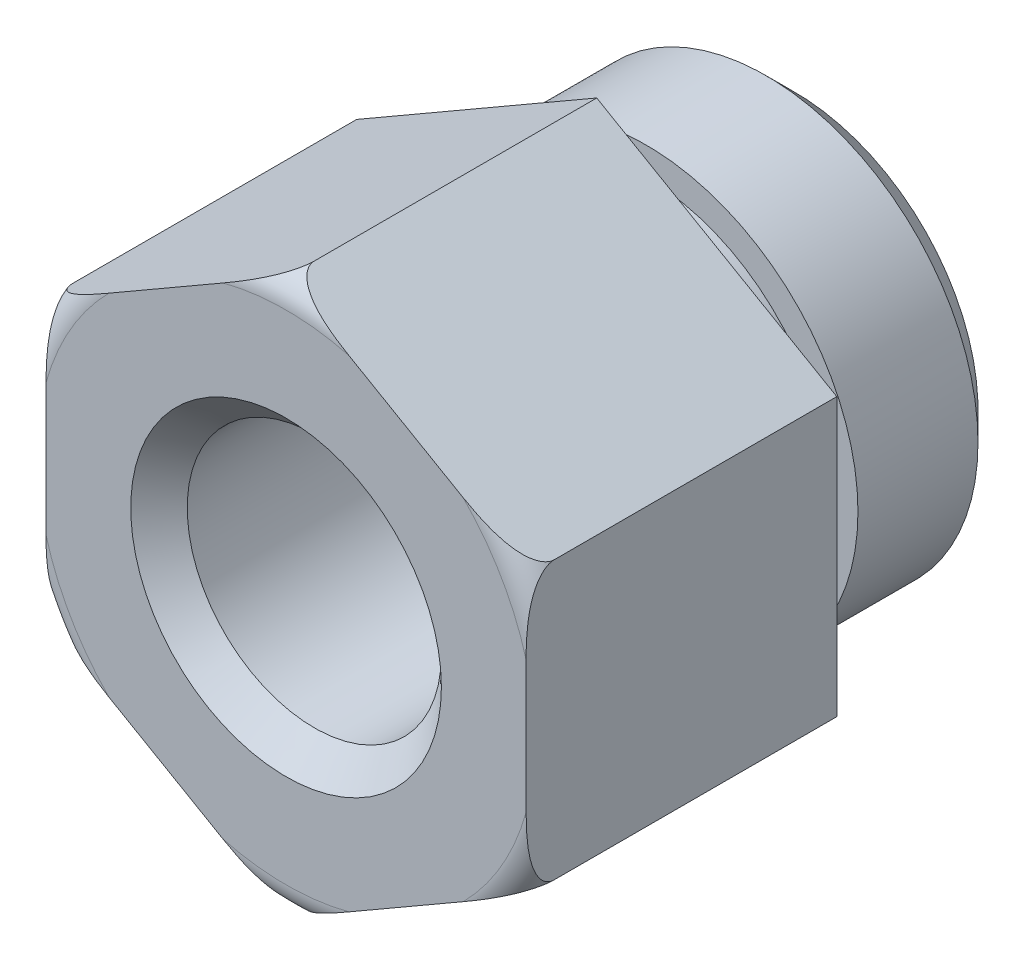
ISO-10303-21;
HEADER;
FILE_DESCRIPTION(('STEP AP214'),'2;1');
FILE_NAME('part.step','',(''),(''),'','','');
FILE_SCHEMA(('AUTOMOTIVE_DESIGN { 1 0 10303 214 1 1 1 1 }'));
ENDSEC;
DATA;
#1=APPLICATION_CONTEXT('core data for automotive mechanical design processes');
#2=APPLICATION_PROTOCOL_DEFINITION('international standard','automotive_design',2000,#1);
#3=PRODUCT_CONTEXT('',#1,'mechanical');
#4=PRODUCT('Part','Part','',(#3));
#5=PRODUCT_RELATED_PRODUCT_CATEGORY('part','',(#4));
#6=PRODUCT_DEFINITION_FORMATION('','',#4);
#7=PRODUCT_DEFINITION_CONTEXT('part definition',#1,'design');
#8=PRODUCT_DEFINITION('design','',#6,#7);
#9=PRODUCT_DEFINITION_SHAPE('','',#8);
#10=(LENGTH_UNIT() NAMED_UNIT(*) SI_UNIT(.MILLI.,.METRE.));
#11=(NAMED_UNIT(*) PLANE_ANGLE_UNIT() SI_UNIT($,.RADIAN.));
#12=(NAMED_UNIT(*) SI_UNIT($,.STERADIAN.) SOLID_ANGLE_UNIT());
#13=UNCERTAINTY_MEASURE_WITH_UNIT(LENGTH_MEASURE(1.E-05),#10,'distance_accuracy_value','');
#14=(GEOMETRIC_REPRESENTATION_CONTEXT(3) GLOBAL_UNCERTAINTY_ASSIGNED_CONTEXT((#13)) GLOBAL_UNIT_ASSIGNED_CONTEXT((#10,
#11,#12)) REPRESENTATION_CONTEXT('',''));
#15=CARTESIAN_POINT('',(0.,0.,0.));
#16=DIRECTION('',(0.,0.,1.));
#17=DIRECTION('',(1.,0.,0.));
#18=AXIS2_PLACEMENT_3D('',#15,#16,#17);
#19=CARTESIAN_POINT('',(-17.,9.81495457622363,22.));
#20=DIRECTION('',(-0.5,0.866025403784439,0.));
#21=DIRECTION('',(-0.866025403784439,-0.5,0.));
#22=AXIS2_PLACEMENT_3D('',#19,#20,#21);
#23=PLANE('',#22);
#24=DIRECTION('',(0.,0.,-1.));
#25=VECTOR('',#24,1.);
#26=CARTESIAN_POINT('',(-17.,9.81495457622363,22.));
#27=LINE('',#26,#25);
#28=CARTESIAN_POINT('',(-17.,9.81495457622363,20.));
#29=VERTEX_POINT('',#28);
#30=CARTESIAN_POINT('',(-17.,9.81495457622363,0.));
#31=VERTEX_POINT('',#30);
#32=EDGE_CURVE('E157',#29,#31,#27,.T.);
#33=ORIENTED_EDGE('',*,*,#32,.F.);
#34=CARTESIAN_POINT('',(-16.9999999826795,9.81495458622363,19.9998));
#35=CARTESIAN_POINT('',(-17.0000108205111,9.81494832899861,20.029813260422));
#36=CARTESIAN_POINT('',(-16.9988392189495,9.81562475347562,20.0598100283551));
#37=CARTESIAN_POINT('',(-16.9941919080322,9.81830787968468,20.1195407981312));
#38=CARTESIAN_POINT('',(-16.9907180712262,9.82031350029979,20.1492749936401));
#39=CARTESIAN_POINT('',(-16.9770157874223,9.82822451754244,20.237270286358));
#40=CARTESIAN_POINT('',(-16.9635041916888,9.83602544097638,20.2948829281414));
#41=CARTESIAN_POINT('',(-16.9288469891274,9.85603478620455,20.4066736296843));
#42=CARTESIAN_POINT('',(-16.9077240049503,9.8682301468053,20.4608613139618));
#43=CARTESIAN_POINT('',(-16.8591613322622,9.89626781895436,20.5654072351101));
#44=CARTESIAN_POINT('',(-16.8317079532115,9.91211803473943,20.6157568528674));
#45=CARTESIAN_POINT('',(-16.7513777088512,9.9584967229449,20.7452053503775));
#46=CARTESIAN_POINT('',(-16.6939258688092,9.9916665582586,20.8205102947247));
#47=CARTESIAN_POINT('',(-16.5696837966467,10.0633977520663,20.9600858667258));
#48=CARTESIAN_POINT('',(-16.5028637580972,10.1019763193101,21.0243197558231));
#49=CARTESIAN_POINT('',(-16.3718515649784,10.1776162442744,21.1356208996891));
#50=CARTESIAN_POINT('',(-16.3083735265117,10.2142653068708,21.1838302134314));
#51=CARTESIAN_POINT('',(-16.1780423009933,10.2895120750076,21.2737926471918));
#52=CARTESIAN_POINT('',(-16.1111864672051,10.3281113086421,21.3155405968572));
#53=CARTESIAN_POINT('',(-15.9750786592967,10.4066931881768,21.3933983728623));
#54=CARTESIAN_POINT('',(-15.9058265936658,10.4466758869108,21.429507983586));
#55=CARTESIAN_POINT('',(-15.7655912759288,10.5276407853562,21.4968046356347));
#56=CARTESIAN_POINT('',(-15.6946085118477,10.5686227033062,21.5279930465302));
#57=CARTESIAN_POINT('',(-15.5273344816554,10.6651984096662,21.5958123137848));
#58=CARTESIAN_POINT('',(-15.4305342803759,10.7210860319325,21.630763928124));
#59=CARTESIAN_POINT('',(-15.235343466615,10.8337795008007,21.6942181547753));
#60=CARTESIAN_POINT('',(-15.1369521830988,10.8905857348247,21.7227179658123));
#61=CARTESIAN_POINT('',(-14.9389568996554,11.004898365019,21.7742492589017));
#62=CARTESIAN_POINT('',(-14.8393512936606,11.0624056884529,21.7972724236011));
#63=CARTESIAN_POINT('',(-14.6394047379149,11.1778448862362,21.8385892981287));
#64=CARTESIAN_POINT('',(-14.539063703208,11.235776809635,21.8568824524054));
#65=CARTESIAN_POINT('',(-14.3369601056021,11.352461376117,21.8895505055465));
#66=CARTESIAN_POINT('',(-14.2351929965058,11.4112166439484,21.9038874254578));
#67=CARTESIAN_POINT('',(-14.0313285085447,11.5289178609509,21.9289981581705));
#68=CARTESIAN_POINT('',(-13.9292311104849,11.5878638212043,21.9397717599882));
#69=CARTESIAN_POINT('',(-13.724940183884,11.7058112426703,21.9582498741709));
#70=CARTESIAN_POINT('',(-13.622746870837,11.7648125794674,21.9659576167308));
#71=CARTESIAN_POINT('',(-13.4182538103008,11.8828767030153,21.9787602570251));
#72=CARTESIAN_POINT('',(-13.3159540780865,11.9419394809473,21.9838554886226));
#73=CARTESIAN_POINT('',(-12.9914733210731,12.1292785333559,21.9965136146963));
#74=CARTESIAN_POINT('',(-12.7691733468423,12.2576234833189,21.9999805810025));
#75=CARTESIAN_POINT('',(-12.3245651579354,12.5143181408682,22.0000192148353));
#76=CARTESIAN_POINT('',(-12.1022569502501,12.6426678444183,21.9965895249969));
#77=CARTESIAN_POINT('',(-11.6575429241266,12.8994236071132,21.9857611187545));
#78=CARTESIAN_POINT('',(-11.4351371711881,13.0278296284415,21.9783592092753));
#79=CARTESIAN_POINT('',(-10.9903850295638,13.2846073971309,21.962123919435));
#80=CARTESIAN_POINT('',(-10.7680386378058,13.4129791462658,21.9532906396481));
#81=CARTESIAN_POINT('',(-10.3227849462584,13.6700464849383,21.9363159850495));
#82=CARTESIAN_POINT('',(-10.0998775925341,13.7987421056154,21.9281763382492));
#83=CARTESIAN_POINT('',(-9.65400230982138,14.0561683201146,21.9143102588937));
#84=CARTESIAN_POINT('',(-9.43103438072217,14.1848989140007,21.9085838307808));
#85=CARTESIAN_POINT('',(-8.98523554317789,14.4422809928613,21.9006618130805));
#86=CARTESIAN_POINT('',(-8.76240467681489,14.5709324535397,21.8984632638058));
#87=CARTESIAN_POINT('',(-8.31674160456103,14.8282361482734,21.8980044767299));
#88=CARTESIAN_POINT('',(-8.09390939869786,14.9568883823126,21.899744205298));
#89=CARTESIAN_POINT('',(-7.65081097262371,15.212711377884,21.9067918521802));
#90=CARTESIAN_POINT('',(-7.43054423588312,15.3398824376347,21.9120591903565));
#91=CARTESIAN_POINT('',(-6.99006426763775,15.5941936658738,21.9251243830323));
#92=CARTESIAN_POINT('',(-6.76985103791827,15.7213338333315,21.9329223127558));
#93=CARTESIAN_POINT('',(-6.32912935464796,15.9757846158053,21.9494945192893));
#94=CARTESIAN_POINT('',(-6.10862094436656,16.1030952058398,21.9582702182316));
#95=CARTESIAN_POINT('',(-5.66758131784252,16.3577295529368,21.9747565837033));
#96=CARTESIAN_POINT('',(-5.4470501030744,16.4850533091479,21.9824672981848));
#97=CARTESIAN_POINT('',(-5.00702095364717,16.739104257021,21.9943778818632));
#98=CARTESIAN_POINT('',(-4.78752342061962,16.8658312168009,21.9985952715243));
#99=CARTESIAN_POINT('',(-4.3484321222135,17.1193406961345,22.0008251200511));
#100=CARTESIAN_POINT('',(-4.12883834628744,17.2461232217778,21.9988362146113));
#101=CARTESIAN_POINT('',(-3.69032289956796,17.499300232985,21.9854189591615));
#102=CARTESIAN_POINT('',(-3.47140080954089,17.6256949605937,21.9740112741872));
#103=CARTESIAN_POINT('',(-3.03440724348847,17.8779933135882,21.937860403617));
#104=CARTESIAN_POINT('',(-2.81633531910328,18.0038971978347,21.9131256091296));
#105=CARTESIAN_POINT('',(-2.56083233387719,18.1514119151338,21.8731287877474));
#106=CARTESIAN_POINT('',(-2.52233045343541,18.1736409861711,21.8668050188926));
#107=CARTESIAN_POINT('',(-2.44540276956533,18.2180552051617,21.8535344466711));
#108=CARTESIAN_POINT('',(-2.4069769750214,18.2402403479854,21.8465875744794));
#109=CARTESIAN_POINT('',(-2.29180819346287,18.3067330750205,21.8247544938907));
#110=CARTESIAN_POINT('',(-2.21520322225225,18.3509609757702,21.8088803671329));
#111=CARTESIAN_POINT('',(-2.06212370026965,18.4393414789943,21.7740883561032));
#112=CARTESIAN_POINT('',(-1.98565158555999,18.4834926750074,21.7551560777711));
#113=CARTESIAN_POINT('',(-1.83339873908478,18.5713958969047,21.7139223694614));
#114=CARTESIAN_POINT('',(-1.75761792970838,18.6151479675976,21.6916213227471));
#115=CARTESIAN_POINT('',(-1.57731889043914,18.7192436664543,21.6336795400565));
#116=CARTESIAN_POINT('',(-1.47322442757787,18.7793426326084,21.5962424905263));
#117=CARTESIAN_POINT('',(-1.26759656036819,18.8980619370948,21.5124523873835));
#118=CARTESIAN_POINT('',(-1.16606584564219,18.9566807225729,21.4660903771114));
#119=CARTESIAN_POINT('',(-0.967876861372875,19.0711051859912,21.3629697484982));
#120=CARTESIAN_POINT('',(-0.871188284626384,19.1269283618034,21.3062899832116));
#121=CARTESIAN_POINT('',(-0.684442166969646,19.2347462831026,21.1800522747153));
#122=CARTESIAN_POINT('',(-0.59436758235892,19.2867508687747,21.1105291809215));
#123=CARTESIAN_POINT('',(-0.456508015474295,19.3663441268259,20.984651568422));
#124=CARTESIAN_POINT('',(-0.40548091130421,19.3958046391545,20.933057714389));
#125=CARTESIAN_POINT('',(-0.309191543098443,19.4513973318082,20.8229243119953));
#126=CARTESIAN_POINT('',(-0.263934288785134,19.4775266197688,20.7643788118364));
#127=CARTESIAN_POINT('',(-0.180975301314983,19.5254230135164,20.6391759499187));
#128=CARTESIAN_POINT('',(-0.14338046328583,19.5471284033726,20.5724222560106));
#129=CARTESIAN_POINT('',(-0.0797289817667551,19.583877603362,20.43205837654));
#130=CARTESIAN_POINT('',(-0.0536228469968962,19.5989499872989,20.3584792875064));
#131=CARTESIAN_POINT('',(-0.0234395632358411,19.6163763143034,20.2367422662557));
#132=CARTESIAN_POINT('',(-0.0147313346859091,19.6214040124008,20.1900922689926));
#133=CARTESIAN_POINT('',(-0.00296805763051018,19.6281955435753,20.0955895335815));
#134=CARTESIAN_POINT('',(5.47012501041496E-05,19.6299407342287,20.0477314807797));
#135=CARTESIAN_POINT('',(-1.7320500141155E-08,19.6299091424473,19.9998));
#136=B_SPLINE_CURVE_WITH_KNOTS('',3,(#34,#35,#36,#37,#38,#39,#40,#41,#42,#43,#44,#45,#46,#47,
#48,#49,#50,#51,#52,#53,#54,#55,#56,#57,#58,#59,#60,#61,#62,#63,#64,#65,#66,#67,#68,#69,#70,#71,
#72,#73,#74,#75,#76,#77,#78,#79,#80,#81,#82,#83,#84,#85,#86,#87,#88,#89,#90,#91,#92,#93,#94,#95,
#96,#97,#98,#99,#100,#101,#102,#103,#104,#105,#106,#107,#108,#109,#110,#111,#112,#113,#114,#115,
#116,#117,#118,#119,#120,#121,#122,#123,#124,#125,#126,#127,#128,#129,#130,#131,#132,#133,#134,
#135),.UNSPECIFIED.,.F.,.F.,(4,2,2,2,2,2,2,2,2,2,2,2,2,2,2,2,2,2,2,2,2,2,2,2,2,2,2,2,2,2,2,2,2,
2,2,2,2,2,2,2,2,2,2,2,2,2,2,2,2,2,4),(0.,0.089977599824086,0.179882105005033,0.358038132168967,
0.53566895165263,0.713687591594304,1.01303516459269,1.31335773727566,1.5761711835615,
1.83919385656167,2.10222658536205,2.36518598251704,2.71627661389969,3.06751939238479,
3.41929224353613,3.77110639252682,4.12618886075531,4.48129234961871,4.83602070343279,
5.19070371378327,5.96067447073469,6.73079678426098,7.50153909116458,8.27222726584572,
9.04478246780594,9.81733909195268,10.5892472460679,11.3611488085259,12.1243198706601,
12.8875136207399,13.6518322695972,14.4161164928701,15.176543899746,15.9371384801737,
16.6960687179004,17.4545216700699,17.5892353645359,17.7239639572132,17.9935239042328,
18.26439170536,18.5352287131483,18.9126214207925,19.2903948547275,19.6653939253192,
20.0393900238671,20.2738868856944,20.508585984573,20.7463637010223,20.9831068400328,
21.125838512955,21.2693783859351),.UNSPECIFIED.);
#137=CARTESIAN_POINT('',(-12.5447833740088,12.3871750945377,22.));
#138=VERTEX_POINT('',#137);
#139=EDGE_CURVE('E209',#29,#138,#136,.T.);
#140=ORIENTED_EDGE('',*,*,#139,.T.);
#141=DIRECTION('',(0.866025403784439,0.5,0.));
#142=VECTOR('',#141,1.);
#143=CARTESIAN_POINT('',(-17.,9.81495457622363,22.));
#144=LINE('',#143,#142);
#145=CARTESIAN_POINT('',(-4.45521662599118,17.0576886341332,22.));
#146=VERTEX_POINT('',#145);
#147=EDGE_CURVE('E281',#138,#146,#144,.T.);
#148=ORIENTED_EDGE('',*,*,#147,.T.);
#149=CARTESIAN_POINT('',(0.,19.6299091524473,20.));
#150=VERTEX_POINT('',#149);
#151=EDGE_CURVE('E202',#146,#150,#136,.T.);
#152=ORIENTED_EDGE('',*,*,#151,.T.);
#153=DIRECTION('',(0.,0.,-1.));
#154=VECTOR('',#153,1.);
#155=CARTESIAN_POINT('',(0.,19.6299091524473,22.));
#156=LINE('',#155,#154);
#157=CARTESIAN_POINT('',(0.,19.6299091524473,0.));
#158=VERTEX_POINT('',#157);
#159=EDGE_CURVE('E146',#150,#158,#156,.T.);
#160=ORIENTED_EDGE('',*,*,#159,.T.);
#161=DIRECTION('',(0.866025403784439,0.5,0.));
#162=VECTOR('',#161,1.);
#163=CARTESIAN_POINT('',(-17.,9.81495457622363,0.));
#164=LINE('',#163,#162);
#165=EDGE_CURVE('E288',#31,#158,#164,.T.);
#166=ORIENTED_EDGE('',*,*,#165,.F.);
#167=EDGE_LOOP('',(#33,#140,#148,#152,#160,#166));
#168=FACE_BOUND('',#167,.T.);
#169=ADVANCED_FACE('F34',(#168),#23,.T.);
#170=CARTESIAN_POINT('',(-17.,-9.81495457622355,22.));
#171=DIRECTION('',(-1.,0.,0.));
#172=DIRECTION('',(0.,-1.,0.));
#173=AXIS2_PLACEMENT_3D('',#170,#171,#172);
#174=PLANE('',#173);
#175=DIRECTION('',(0.,1.,0.));
#176=VECTOR('',#175,1.);
#177=CARTESIAN_POINT('',(-17.,-9.81495457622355,22.));
#178=LINE('',#177,#176);
#179=CARTESIAN_POINT('',(-17.,-4.67051353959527,22.));
#180=VERTEX_POINT('',#179);
#181=CARTESIAN_POINT('',(-17.,4.67051353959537,22.));
#182=VERTEX_POINT('',#181);
#183=EDGE_CURVE('E150',#180,#182,#178,.T.);
#184=ORIENTED_EDGE('',*,*,#183,.T.);
#185=CARTESIAN_POINT('',(-17.,0.,21.8982134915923));
#186=CARTESIAN_POINT('',(-17.,0.332390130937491,21.8982192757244));
#187=CARTESIAN_POINT('',(-17.,0.664781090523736,21.9015372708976));
#188=CARTESIAN_POINT('',(-17.,1.3294919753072,21.9137848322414));
#189=CARTESIAN_POINT('',(-17.,1.66181188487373,21.922715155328));
#190=CARTESIAN_POINT('',(-17.,2.32844790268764,21.9433371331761));
#191=CARTESIAN_POINT('',(-17.,2.66276342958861,21.9550457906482));
#192=CARTESIAN_POINT('',(-17.,3.33135184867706,21.9767550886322));
#193=CARTESIAN_POINT('',(-17.,3.66562472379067,21.9867562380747));
#194=CARTESIAN_POINT('',(-17.,4.33827607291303,21.999572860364));
#195=CARTESIAN_POINT('',(-17.,4.67665695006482,22.0023031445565));
#196=CARTESIAN_POINT('',(-17.,5.18435903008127,21.9955041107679));
#197=CARTESIAN_POINT('',(-17.,5.35374209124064,21.99141484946));
#198=CARTESIAN_POINT('',(-17.,5.69232871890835,21.9785175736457));
#199=CARTESIAN_POINT('',(-17.,5.8615322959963,21.9697098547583));
#200=CARTESIAN_POINT('',(-17.,6.19773859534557,21.9462853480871));
#201=CARTESIAN_POINT('',(-17.,6.36474555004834,21.931731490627));
#202=CARTESIAN_POINT('',(-17.,6.69804534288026,21.895402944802));
#203=CARTESIAN_POINT('',(-17.,6.86433796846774,21.87362624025));
#204=CARTESIAN_POINT('',(-17.,7.19506376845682,21.8212043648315));
#205=CARTESIAN_POINT('',(-17.,7.35950086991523,21.7905844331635));
#206=CARTESIAN_POINT('',(-17.,7.6858917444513,21.7183059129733));
#207=CARTESIAN_POINT('',(-17.,7.84784742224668,21.6766562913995));
#208=CARTESIAN_POINT('',(-17.,8.0709278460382,21.6088190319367));
#209=CARTESIAN_POINT('',(-17.,8.1338477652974,21.5884951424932));
#210=CARTESIAN_POINT('',(-17.,8.25886208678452,21.5454332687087));
#211=CARTESIAN_POINT('',(-17.,8.32095638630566,21.522694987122));
#212=CARTESIAN_POINT('',(-17.,8.50599401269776,21.450380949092));
#213=CARTESIAN_POINT('',(-17.,8.62742463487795,21.3967847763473));
#214=CARTESIAN_POINT('',(-17.,8.86475502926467,21.2759550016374));
#215=CARTESIAN_POINT('',(-17.,8.98059658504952,21.208605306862));
#216=CARTESIAN_POINT('',(-17.,9.20097367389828,21.0574073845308));
#217=CARTESIAN_POINT('',(-17.,9.30554671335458,20.9736166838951));
#218=CARTESIAN_POINT('',(-17.,9.45221250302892,20.8287210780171));
#219=CARTESIAN_POINT('',(-17.,9.50113323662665,20.7745609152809));
#220=CARTESIAN_POINT('',(-17.,9.59108363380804,20.6599196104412));
#221=CARTESIAN_POINT('',(-17.,9.63211326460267,20.5994384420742));
#222=CARTESIAN_POINT('',(-17.,9.70404899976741,20.4715612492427));
#223=CARTESIAN_POINT('',(-17.,9.7348175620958,20.4040860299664));
#224=CARTESIAN_POINT('',(-17.,9.78234765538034,20.2643741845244));
#225=CARTESIAN_POINT('',(-17.,9.79913873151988,20.192147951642));
#226=CARTESIAN_POINT('',(-17.,9.81540796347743,20.0557847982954));
#227=CARTESIAN_POINT('',(-17.,9.81693908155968,19.991891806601));
#228=CARTESIAN_POINT('',(-17.,9.80784607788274,19.8649739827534));
#229=CARTESIAN_POINT('',(-17.,9.79722003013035,19.801949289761));
#230=CARTESIAN_POINT('',(-17.,9.76662904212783,19.6853536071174));
#231=CARTESIAN_POINT('',(-17.,9.7477629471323,19.6314851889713));
#232=CARTESIAN_POINT('',(-17.,9.70251063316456,19.5270523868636));
#233=CARTESIAN_POINT('',(-17.,9.67612319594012,19.4764885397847));
#234=CARTESIAN_POINT('',(-17.,9.6002722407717,19.3511137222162));
#235=CARTESIAN_POINT('',(-17.,9.54626044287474,19.2790602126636));
#236=CARTESIAN_POINT('',(-17.,9.42763422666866,19.1442308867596));
#237=CARTESIAN_POINT('',(-17.,9.36298771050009,19.0814842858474));
#238=CARTESIAN_POINT('',(-17.,9.23765644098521,18.9740941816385));
#239=CARTESIAN_POINT('',(-17.,9.17804990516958,18.9281678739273));
#240=CARTESIAN_POINT('',(-17.,9.05506969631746,18.8416325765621));
#241=CARTESIAN_POINT('',(-17.,8.99169334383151,18.8010274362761));
#242=CARTESIAN_POINT('',(-17.,8.79732041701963,18.686230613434));
#243=CARTESIAN_POINT('',(-17.,8.66214740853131,18.6191118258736));
#244=CARTESIAN_POINT('',(-17.,8.38339236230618,18.4987968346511));
#245=CARTESIAN_POINT('',(-17.,8.23970924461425,18.445845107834));
#246=CARTESIAN_POINT('',(-17.,7.94832246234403,18.3520701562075));
#247=CARTESIAN_POINT('',(-17.,7.80061433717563,18.3112610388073));
#248=CARTESIAN_POINT('',(-17.,7.50238872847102,18.2393826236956));
#249=CARTESIAN_POINT('',(-17.,7.35186366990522,18.2083454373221));
#250=CARTESIAN_POINT('',(-17.,7.12509398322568,18.1678776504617));
#251=CARTESIAN_POINT('',(-17.,7.04937152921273,18.1554069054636));
#252=CARTESIAN_POINT('',(-17.,6.89765071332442,18.1323020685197));
#253=CARTESIAN_POINT('',(-17.,6.82165236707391,18.1216678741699));
#254=CARTESIAN_POINT('',(-17.,6.56533470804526,18.0886444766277));
#255=CARTESIAN_POINT('',(-17.,6.38451887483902,18.070073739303));
#256=CARTESIAN_POINT('',(-17.,6.02226849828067,18.0402864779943));
#257=CARTESIAN_POINT('',(-17.,5.84083379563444,18.0290720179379));
#258=CARTESIAN_POINT('',(-17.,5.47754121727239,18.0124139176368));
#259=CARTESIAN_POINT('',(-17.,5.29568310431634,18.0069756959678));
#260=CARTESIAN_POINT('',(-17.,4.93188222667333,18.0005439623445));
#261=CARTESIAN_POINT('',(-17.,4.74993945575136,17.9995508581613));
#262=CARTESIAN_POINT('',(-17.,4.20274704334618,18.0014449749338));
#263=CARTESIAN_POINT('',(-17.,3.83752765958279,18.0092506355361));
#264=CARTESIAN_POINT('',(-17.,3.10745524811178,18.0298274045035));
#265=CARTESIAN_POINT('',(-17.,2.74260212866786,18.0425961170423));
#266=CARTESIAN_POINT('',(-17.,2.19474201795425,18.0607275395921));
#267=CARTESIAN_POINT('',(-17.,2.01175598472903,18.0666089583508));
#268=CARTESIAN_POINT('',(-17.,1.64575664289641,18.0774044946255));
#269=CARTESIAN_POINT('',(-17.,1.46274333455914,18.082318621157));
#270=CARTESIAN_POINT('',(-17.,1.0966750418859,18.0906741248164));
#271=CARTESIAN_POINT('',(-17.,0.913620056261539,18.0941154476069));
#272=CARTESIAN_POINT('',(-17.,0.547484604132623,18.0991878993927));
#273=CARTESIAN_POINT('',(-17.,0.364404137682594,18.1008190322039));
#274=CARTESIAN_POINT('',(-17.,-0.00141918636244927,18.1021115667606));
#275=CARTESIAN_POINT('',(-17.,-0.184162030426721,18.1017766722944));
#276=CARTESIAN_POINT('',(-17.,-0.549633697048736,18.0991781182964));
#277=CARTESIAN_POINT('',(-17.,-0.73236251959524,18.0969144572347));
#278=CARTESIAN_POINT('',(-17.,-1.09779768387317,18.090677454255));
#279=CARTESIAN_POINT('',(-17.,-1.28050402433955,18.0867040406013));
#280=CARTESIAN_POINT('',(-17.,-1.64588275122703,18.0774405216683));
#281=CARTESIAN_POINT('',(-17.,-1.82855513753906,18.0721504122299));
#282=CARTESIAN_POINT('',(-17.,-2.19237262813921,18.0608463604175));
#283=CARTESIAN_POINT('',(-17.,-2.37351793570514,18.0548387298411));
#284=CARTESIAN_POINT('',(-17.,-2.7358022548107,18.0427252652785));
#285=CARTESIAN_POINT('',(-17.,-2.91694126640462,18.0366194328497));
#286=CARTESIAN_POINT('',(-17.,-3.27938197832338,18.0250724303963));
#287=CARTESIAN_POINT('',(-17.,-3.4606836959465,18.0196317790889));
#288=CARTESIAN_POINT('',(-17.,-3.82332854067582,18.010287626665));
#289=CARTESIAN_POINT('',(-17.,-4.00467166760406,18.0063841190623));
#290=CARTESIAN_POINT('',(-17.,-4.36732890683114,18.001079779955));
#291=CARTESIAN_POINT('',(-17.,-4.54864300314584,17.9996779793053));
#292=CARTESIAN_POINT('',(-17.,-4.91126157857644,18.0004474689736));
#293=CARTESIAN_POINT('',(-17.,-5.09256605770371,18.002618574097));
#294=CARTESIAN_POINT('',(-17.,-5.45492479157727,18.0117410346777));
#295=CARTESIAN_POINT('',(-17.,-5.63597913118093,18.0186886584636));
#296=CARTESIAN_POINT('',(-17.,-5.99773438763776,18.0387523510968));
#297=CARTESIAN_POINT('',(-17.,-6.17843535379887,18.0518674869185));
#298=CARTESIAN_POINT('',(-17.,-6.54102830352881,18.0860986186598));
#299=CARTESIAN_POINT('',(-17.,-6.72291280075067,18.1072973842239));
#300=CARTESIAN_POINT('',(-17.,-7.08537925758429,18.1598025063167));
#301=CARTESIAN_POINT('',(-17.,-7.26596022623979,18.1911158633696));
#302=CARTESIAN_POINT('',(-17.,-7.62472970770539,18.2665931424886));
#303=CARTESIAN_POINT('',(-17.,-7.80291570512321,18.3107696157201));
#304=CARTESIAN_POINT('',(-17.,-8.06639835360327,18.3893863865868));
#305=CARTESIAN_POINT('',(-17.,-8.15354863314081,18.4176326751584));
#306=CARTESIAN_POINT('',(-17.,-8.32616335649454,18.478848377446));
#307=CARTESIAN_POINT('',(-17.,-8.41162830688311,18.5118163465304));
#308=CARTESIAN_POINT('',(-17.,-8.58150811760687,18.5837000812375));
#309=CARTESIAN_POINT('',(-17.,-8.66588969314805,18.6226952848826));
#310=CARTESIAN_POINT('',(-17.,-8.83132845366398,18.7071341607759));
#311=CARTESIAN_POINT('',(-17.,-8.91238801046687,18.7525731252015));
#312=CARTESIAN_POINT('',(-17.,-9.06924837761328,18.850578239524));
#313=CARTESIAN_POINT('',(-17.,-9.14508559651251,18.9030853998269));
#314=CARTESIAN_POINT('',(-17.,-9.29004565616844,19.0165684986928));
#315=CARTESIAN_POINT('',(-17.,-9.35918218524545,19.0775265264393));
#316=CARTESIAN_POINT('',(-17.,-9.47087575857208,19.1917608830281));
#317=CARTESIAN_POINT('',(-17.,-9.5156472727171,19.2428565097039));
#318=CARTESIAN_POINT('',(-17.,-9.59819878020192,19.3505510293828));
#319=CARTESIAN_POINT('',(-17.,-9.63597477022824,19.4071530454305));
#320=CARTESIAN_POINT('',(-17.,-9.70264096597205,19.5262217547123));
#321=CARTESIAN_POINT('',(-17.,-9.73143793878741,19.588741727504));
#322=CARTESIAN_POINT('',(-17.,-9.77712032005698,19.7179962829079));
#323=CARTESIAN_POINT('',(-17.,-9.79402369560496,19.7847243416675));
#324=CARTESIAN_POINT('',(-17.,-9.81343247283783,19.9158309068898));
#325=CARTESIAN_POINT('',(-17.,-9.81680399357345,19.9800793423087));
#326=CARTESIAN_POINT('',(-17.,-9.81116411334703,20.1080282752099));
#327=CARTESIAN_POINT('',(-17.,-9.8021523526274,20.1717287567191));
#328=CARTESIAN_POINT('',(-17.,-9.77439643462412,20.2893143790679));
#329=CARTESIAN_POINT('',(-17.,-9.75686602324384,20.3434956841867));
#330=CARTESIAN_POINT('',(-17.,-9.71410104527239,20.4486891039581));
#331=CARTESIAN_POINT('',(-17.,-9.68886437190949,20.49970034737));
#332=CARTESIAN_POINT('',(-17.,-9.61679045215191,20.6244718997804));
#333=CARTESIAN_POINT('',(-17.,-9.56563257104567,20.6957302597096));
#334=CARTESIAN_POINT('',(-17.,-9.45277432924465,20.8293654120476));
#335=CARTESIAN_POINT('',(-17.,-9.39104525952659,20.8917171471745));
#336=CARTESIAN_POINT('',(-17.,-9.27167516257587,20.9980807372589));
#337=CARTESIAN_POINT('',(-17.,-9.2151756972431,21.0433990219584));
#338=CARTESIAN_POINT('',(-17.,-9.09844685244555,21.1289815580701));
#339=CARTESIAN_POINT('',(-17.,-9.03821489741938,21.1692422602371));
#340=CARTESIAN_POINT('',(-17.,-8.85321070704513,21.2833610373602));
#341=CARTESIAN_POINT('',(-17.,-8.7242601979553,21.3504467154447));
#342=CARTESIAN_POINT('',(-17.,-8.45966955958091,21.4704390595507));
#343=CARTESIAN_POINT('',(-17.,-8.32400871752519,21.5232981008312));
#344=CARTESIAN_POINT('',(-17.,-8.04865127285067,21.6175135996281));
#345=CARTESIAN_POINT('',(-17.,-7.9089505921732,21.6588579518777));
#346=CARTESIAN_POINT('',(-17.,-7.62689567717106,21.732198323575));
#347=CARTESIAN_POINT('',(-17.,-7.48453702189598,21.7641769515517));
#348=CARTESIAN_POINT('',(-17.,-7.19838247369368,21.8203562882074));
#349=CARTESIAN_POINT('',(-17.,-7.05458720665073,21.8445602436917));
#350=CARTESIAN_POINT('',(-17.,-6.76832320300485,21.8862166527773));
#351=CARTESIAN_POINT('',(-17.,-6.62586859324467,21.903768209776));
#352=CARTESIAN_POINT('',(-17.,-6.3404073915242,21.9336833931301));
#353=CARTESIAN_POINT('',(-17.,-6.19740072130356,21.9460462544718));
#354=CARTESIAN_POINT('',(-17.,-5.76776687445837,21.9767092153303));
#355=CARTESIAN_POINT('',(-17.,-5.48068463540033,21.9885627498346));
#356=CARTESIAN_POINT('',(-17.,-4.90621712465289,22.0008103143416));
#357=CARTESIAN_POINT('',(-17.,-4.61883177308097,22.0011980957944));
#358=CARTESIAN_POINT('',(-17.,-4.0441137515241,21.9950354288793));
#359=CARTESIAN_POINT('',(-17.,-3.75678109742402,21.9884838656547));
#360=CARTESIAN_POINT('',(-17.,-3.18001388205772,21.9722071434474));
#361=CARTESIAN_POINT('',(-17.,-2.89058011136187,21.9624580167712));
#362=CARTESIAN_POINT('',(-17.,-2.3116892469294,21.9430874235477));
#363=CARTESIAN_POINT('',(-17.,-2.02223215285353,21.9334659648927));
#364=CARTESIAN_POINT('',(-17.,-1.44400745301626,21.9169677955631));
#365=CARTESIAN_POINT('',(-17.,-1.15524007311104,21.9100838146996));
#366=CARTESIAN_POINT('',(-17.,-0.577648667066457,21.9007043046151));
#367=CARTESIAN_POINT('',(-17.,-0.288824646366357,21.898208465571));
#368=CARTESIAN_POINT('',(-17.,0.,21.8982134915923));
#369=B_SPLINE_CURVE_WITH_KNOTS('',3,(#185,#186,#187,#188,#189,#190,#191,#192,#193,#194,#195,
#196,#197,#198,#199,#200,#201,#202,#203,#204,#205,#206,#207,#208,#209,#210,#211,#212,#213,#214,
#215,#216,#217,#218,#219,#220,#221,#222,#223,#224,#225,#226,#227,#228,#229,#230,#231,#232,#233,
#234,#235,#236,#237,#238,#239,#240,#241,#242,#243,#244,#245,#246,#247,#248,#249,#250,#251,#252,
#253,#254,#255,#256,#257,#258,#259,#260,#261,#262,#263,#264,#265,#266,#267,#268,#269,#270,#271,
#272,#273,#274,#275,#276,#277,#278,#279,#280,#281,#282,#283,#284,#285,#286,#287,#288,#289,#290,
#291,#292,#293,#294,#295,#296,#297,#298,#299,#300,#301,#302,#303,#304,#305,#306,#307,#308,#309,
#310,#311,#312,#313,#314,#315,#316,#317,#318,#319,#320,#321,#322,#323,#324,#325,#326,#327,#328,
#329,#330,#331,#332,#333,#334,#335,#336,#337,#338,#339,#340,#341,#342,#343,#344,#345,#346,#347,
#348,#349,#350,#351,#352,#353,#354,#355,#356,#357,#358,#359,#360,#361,#362,#363,#364,#365,#366,
#367,#368),.UNSPECIFIED.,.T.,.F.,(4,2,2,2,2,2,2,2,2,2,2,2,2,2,2,2,2,2,2,2,2,2,2,2,2,2,2,2,2,2,2,
2,2,2,2,2,2,2,2,2,2,2,2,2,2,2,2,2,2,2,2,2,2,2,2,2,2,2,2,2,2,2,2,2,2,2,2,2,2,2,2,2,2,2,2,2,2,2,2,
2,2,2,2,2,2,2,2,2,2,2,2,4),(0.,0.997158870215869,1.99445225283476,2.99801381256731,
4.00127573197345,5.01624162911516,5.52448844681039,6.03270342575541,6.53550042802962,
7.0384378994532,7.53995390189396,8.04106342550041,8.23938293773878,8.43772689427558,
8.83524881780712,9.23627626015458,9.63592475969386,9.85433141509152,10.0727389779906,
10.2939663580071,10.5147249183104,10.7053047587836,10.8959147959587,11.0664925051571,
11.2370978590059,11.5057100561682,11.7751483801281,12.0005677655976,12.2261493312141,
12.6775694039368,13.1363393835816,13.5956403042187,14.0564351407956,14.2866446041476,
14.5168412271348,15.0619233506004,15.6071583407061,16.1529043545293,16.6987004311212,
17.7944747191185,18.8897206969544,19.4389598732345,19.9881939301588,20.5374482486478,
21.0867014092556,21.6349201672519,22.183139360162,22.7313815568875,23.2796254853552,
23.8233598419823,24.3670855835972,24.9112326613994,25.4553774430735,25.9993113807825,
26.5432171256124,27.0866984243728,27.6300975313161,28.179216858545,28.7287170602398,
29.2787552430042,29.5534873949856,29.8281356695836,30.106773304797,30.3852084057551,
30.6614492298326,30.9371132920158,31.1404522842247,31.3439072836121,31.549409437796,
31.7546004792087,31.9464260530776,32.1382571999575,32.3084291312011,32.4786476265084,
32.7403166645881,33.0027079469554,33.219685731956,33.43681494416,33.8715770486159,
34.3077769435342,34.7444336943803,35.1818962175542,35.6191758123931,36.0496578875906,
36.4802034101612,37.3417739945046,38.203814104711,39.0659927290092,39.9347875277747,
40.8036357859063,41.6701608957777,42.5366248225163),.UNSPECIFIED.);
#370=EDGE_CURVE('E345',#182,#29,#369,.T.);
#371=ORIENTED_EDGE('',*,*,#370,.T.);
#372=ORIENTED_EDGE('',*,*,#32,.T.);
#373=DIRECTION('',(0.,1.,0.));
#374=VECTOR('',#373,1.);
#375=CARTESIAN_POINT('',(-17.,-9.81495457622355,0.));
#376=LINE('',#375,#374);
#377=CARTESIAN_POINT('',(-17.,-9.81495457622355,0.));
#378=VERTEX_POINT('',#377);
#379=EDGE_CURVE('E300',#378,#31,#376,.T.);
#380=ORIENTED_EDGE('',*,*,#379,.F.);
#381=DIRECTION('',(0.,0.,-1.));
#382=VECTOR('',#381,1.);
#383=CARTESIAN_POINT('',(-17.,-9.81495457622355,22.));
#384=LINE('',#383,#382);
#385=CARTESIAN_POINT('',(-17.,-9.81495457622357,20.));
#386=VERTEX_POINT('',#385);
#387=EDGE_CURVE('E304',#386,#378,#384,.T.);
#388=ORIENTED_EDGE('',*,*,#387,.F.);
#389=EDGE_CURVE('E246',#386,#180,#369,.T.);
#390=ORIENTED_EDGE('',*,*,#389,.T.);
#391=EDGE_LOOP('',(#184,#371,#372,#380,#388,#390));
#392=FACE_BOUND('',#391,.T.);
#393=ADVANCED_FACE('F186',(#392),#174,.T.);
#394=CARTESIAN_POINT('',(0.,-19.6299091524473,22.));
#395=DIRECTION('',(-0.500000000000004,-0.866025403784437,0.));
#396=DIRECTION('',(0.866025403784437,-0.500000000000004,0.));
#397=AXIS2_PLACEMENT_3D('',#394,#395,#396);
#398=PLANE('',#397);
#399=DIRECTION('',(0.,0.,-1.));
#400=VECTOR('',#399,1.);
#401=CARTESIAN_POINT('',(0.,-19.6299091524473,22.));
#402=LINE('',#401,#400);
#403=CARTESIAN_POINT('',(0.,-19.6299091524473,20.));
#404=VERTEX_POINT('',#403);
#405=CARTESIAN_POINT('',(0.,-19.6299091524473,0.));
#406=VERTEX_POINT('',#405);
#407=EDGE_CURVE('E148',#404,#406,#402,.T.);
#408=ORIENTED_EDGE('',*,*,#407,.F.);
#409=CARTESIAN_POINT('',(-1.73205962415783E-08,-19.6299091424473,19.9998));
#410=CARTESIAN_POINT('',(1.0820511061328E-05,-19.6299153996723,20.029813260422));
#411=CARTESIAN_POINT('',(-0.00116078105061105,-19.6292389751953,20.0598100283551));
#412=CARTESIAN_POINT('',(-0.0058080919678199,-19.6265558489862,20.1195407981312));
#413=CARTESIAN_POINT('',(-0.00928192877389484,-19.6245502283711,20.1492749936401));
#414=CARTESIAN_POINT('',(-0.0229842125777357,-19.6166392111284,20.237270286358));
#415=CARTESIAN_POINT('',(-0.0364958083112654,-19.6088382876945,20.2948829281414));
#416=CARTESIAN_POINT('',(-0.0711530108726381,-19.5888289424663,20.4066736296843));
#417=CARTESIAN_POINT('',(-0.0922759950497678,-19.5766335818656,20.4608613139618));
#418=CARTESIAN_POINT('',(-0.140838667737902,-19.5485959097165,20.5654072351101));
#419=CARTESIAN_POINT('',(-0.168292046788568,-19.5327456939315,20.6157568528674));
#420=CARTESIAN_POINT('',(-0.248622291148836,-19.486367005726,20.7452053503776));
#421=CARTESIAN_POINT('',(-0.306074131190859,-19.4531971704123,20.8205102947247));
#422=CARTESIAN_POINT('',(-0.430316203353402,-19.3814659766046,20.9600858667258));
#423=CARTESIAN_POINT('',(-0.497136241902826,-19.3428874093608,21.0243197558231));
#424=CARTESIAN_POINT('',(-0.628148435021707,-19.2672474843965,21.1356208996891));
#425=CARTESIAN_POINT('',(-0.691626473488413,-19.2305984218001,21.1838302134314));
#426=CARTESIAN_POINT('',(-0.82195769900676,-19.1553516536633,21.2737926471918));
#427=CARTESIAN_POINT('',(-0.888813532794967,-19.1167524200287,21.3155405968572));
#428=CARTESIAN_POINT('',(-1.02492134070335,-19.038170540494,21.3933983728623));
#429=CARTESIAN_POINT('',(-1.09417340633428,-18.9981878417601,21.429507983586));
#430=CARTESIAN_POINT('',(-1.23440872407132,-18.9172229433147,21.4968046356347));
#431=CARTESIAN_POINT('',(-1.30539148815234,-18.8762410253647,21.5279930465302));
#432=CARTESIAN_POINT('',(-1.47266551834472,-18.7796653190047,21.5958123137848));
#433=CARTESIAN_POINT('',(-1.56946571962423,-18.7237776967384,21.630763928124));
#434=CARTESIAN_POINT('',(-1.76465653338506,-18.6110842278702,21.6942181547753));
#435=CARTESIAN_POINT('',(-1.86304781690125,-18.5542779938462,21.7227179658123));
#436=CARTESIAN_POINT('',(-2.06104310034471,-18.4399653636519,21.7742492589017));
#437=CARTESIAN_POINT('',(-2.16064870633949,-18.382458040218,21.7972724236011));
#438=CARTESIAN_POINT('',(-2.36059526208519,-18.2670188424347,21.8385892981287));
#439=CARTESIAN_POINT('',(-2.46093629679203,-18.2090869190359,21.8568824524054));
#440=CARTESIAN_POINT('',(-2.66303989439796,-18.0924023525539,21.8895505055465));
#441=CARTESIAN_POINT('',(-2.76480700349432,-18.0336470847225,21.9038874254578));
#442=CARTESIAN_POINT('',(-2.96867149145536,-17.91594586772,21.9289981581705));
#443=CARTESIAN_POINT('',(-3.07076888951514,-17.8569999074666,21.9397717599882));
#444=CARTESIAN_POINT('',(-3.27505981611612,-17.7390524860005,21.9582498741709));
#445=CARTESIAN_POINT('',(-3.37725312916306,-17.6800511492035,21.9659576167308));
#446=CARTESIAN_POINT('',(-3.58174618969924,-17.5619870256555,21.9787602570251));
#447=CARTESIAN_POINT('',(-3.68404592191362,-17.5029242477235,21.9838554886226));
#448=CARTESIAN_POINT('',(-4.00852667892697,-17.315585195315,21.9965136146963));
#449=CARTESIAN_POINT('',(-4.2308266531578,-17.187240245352,21.9999805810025));
#450=CARTESIAN_POINT('',(-4.67543484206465,-16.9305455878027,22.0000192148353));
#451=CARTESIAN_POINT('',(-4.89774304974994,-16.8021958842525,21.9965895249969));
#452=CARTESIAN_POINT('',(-5.34245707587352,-16.5454401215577,21.9857611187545));
#453=CARTESIAN_POINT('',(-5.56486282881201,-16.4170341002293,21.9783592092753));
#454=CARTESIAN_POINT('',(-6.00961497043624,-16.1602563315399,21.962123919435));
#455=CARTESIAN_POINT('',(-6.23196136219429,-16.0318845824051,21.9532906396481));
#456=CARTESIAN_POINT('',(-6.67721505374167,-15.7748172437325,21.9363159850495));
#457=CARTESIAN_POINT('',(-6.90012240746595,-15.6461216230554,21.9281763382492));
#458=CARTESIAN_POINT('',(-7.3459976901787,-15.3886954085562,21.9143102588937));
#459=CARTESIAN_POINT('',(-7.56896561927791,-15.2599648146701,21.9085838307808));
#460=CARTESIAN_POINT('',(-8.01476445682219,-15.0025827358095,21.9006618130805));
#461=CARTESIAN_POINT('',(-8.23759532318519,-14.8739312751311,21.8984632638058));
#462=CARTESIAN_POINT('',(-8.68325839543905,-14.6166275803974,21.8980044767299));
#463=CARTESIAN_POINT('',(-8.90609060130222,-14.4879753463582,21.899744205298));
#464=CARTESIAN_POINT('',(-9.34918902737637,-14.2321523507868,21.9067918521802));
#465=CARTESIAN_POINT('',(-9.56945576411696,-14.1049812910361,21.9120591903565));
#466=CARTESIAN_POINT('',(-10.0099357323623,-13.850670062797,21.9251243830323));
#467=CARTESIAN_POINT('',(-10.2301489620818,-13.7235298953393,21.9329223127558));
#468=CARTESIAN_POINT('',(-10.6708706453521,-13.4690791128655,21.9494945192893));
#469=CARTESIAN_POINT('',(-10.8913790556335,-13.341768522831,21.9582702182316));
#470=CARTESIAN_POINT('',(-11.3324186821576,-13.087134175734,21.9747565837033));
#471=CARTESIAN_POINT('',(-11.5529498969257,-12.9598104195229,21.9824672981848));
#472=CARTESIAN_POINT('',(-11.9929790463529,-12.7057594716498,21.9943778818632));
#473=CARTESIAN_POINT('',(-12.2124765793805,-12.5790325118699,21.9985952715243));
#474=CARTESIAN_POINT('',(-12.6515678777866,-12.3255230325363,22.0008251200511));
#475=CARTESIAN_POINT('',(-12.8711616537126,-12.1987405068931,21.9988362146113));
#476=CARTESIAN_POINT('',(-13.3096771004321,-11.9455634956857,21.9854189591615));
#477=CARTESIAN_POINT('',(-13.5285991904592,-11.8191687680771,21.9740112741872));
#478=CARTESIAN_POINT('',(-13.9655927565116,-11.5668704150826,21.9378604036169));
#479=CARTESIAN_POINT('',(-14.1836646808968,-11.4409665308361,21.9131256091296));
#480=CARTESIAN_POINT('',(-14.4391676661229,-11.293451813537,21.8731287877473));
#481=CARTESIAN_POINT('',(-14.4776695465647,-11.2712227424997,21.8668050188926));
#482=CARTESIAN_POINT('',(-14.5545972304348,-11.2268085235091,21.8535344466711));
#483=CARTESIAN_POINT('',(-14.5930230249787,-11.2046233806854,21.8465875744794));
#484=CARTESIAN_POINT('',(-14.7081918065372,-11.1381306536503,21.8247544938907));
#485=CARTESIAN_POINT('',(-14.7847967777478,-11.0939027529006,21.8088803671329));
#486=CARTESIAN_POINT('',(-14.9378762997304,-11.0055222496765,21.7740883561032));
#487=CARTESIAN_POINT('',(-15.0143484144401,-10.9613710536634,21.7551560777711));
#488=CARTESIAN_POINT('',(-15.1666012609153,-10.8734678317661,21.7139223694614));
#489=CARTESIAN_POINT('',(-15.2423820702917,-10.8297157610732,21.6916213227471));
#490=CARTESIAN_POINT('',(-15.4226811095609,-10.7256200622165,21.6336795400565));
#491=CARTESIAN_POINT('',(-15.5267755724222,-10.6655210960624,21.5962424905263));
#492=CARTESIAN_POINT('',(-15.7324034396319,-10.546801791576,21.5124523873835));
#493=CARTESIAN_POINT('',(-15.8339341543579,-10.4881830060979,21.4660903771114));
#494=CARTESIAN_POINT('',(-16.0321231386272,-10.3737585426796,21.3629697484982));
#495=CARTESIAN_POINT('',(-16.1288117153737,-10.3179353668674,21.3062899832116));
#496=CARTESIAN_POINT('',(-16.3155578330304,-10.2101174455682,21.1800522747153));
#497=CARTESIAN_POINT('',(-16.4056324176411,-10.1581128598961,21.1105291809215));
#498=CARTESIAN_POINT('',(-16.5434919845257,-10.0785196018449,20.984651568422));
#499=CARTESIAN_POINT('',(-16.5945190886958,-10.0490590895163,20.933057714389));
#500=CARTESIAN_POINT('',(-16.6908084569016,-9.9934663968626,20.8229243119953));
#501=CARTESIAN_POINT('',(-16.7360657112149,-9.96733710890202,20.7643788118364));
#502=CARTESIAN_POINT('',(-16.819024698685,-9.91944071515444,20.6391759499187));
#503=CARTESIAN_POINT('',(-16.8566195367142,-9.89773532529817,20.5724222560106));
#504=CARTESIAN_POINT('',(-16.9202710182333,-9.86098612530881,20.43205837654));
#505=CARTESIAN_POINT('',(-16.9463771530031,-9.84591374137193,20.3584792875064));
#506=CARTESIAN_POINT('',(-16.9765604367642,-9.82848741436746,20.2367422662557));
#507=CARTESIAN_POINT('',(-16.9852686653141,-9.82345971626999,20.1900922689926));
#508=CARTESIAN_POINT('',(-16.9970319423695,-9.81666818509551,20.0955895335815));
#509=CARTESIAN_POINT('',(-17.0000547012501,-9.81492299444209,20.0477314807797));
#510=CARTESIAN_POINT('',(-16.9999999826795,-9.81495458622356,19.9998));
#511=B_SPLINE_CURVE_WITH_KNOTS('',3,(#409,#410,#411,#412,#413,#414,#415,#416,#417,#418,#419,
#420,#421,#422,#423,#424,#425,#426,#427,#428,#429,#430,#431,#432,#433,#434,#435,#436,#437,#438,
#439,#440,#441,#442,#443,#444,#445,#446,#447,#448,#449,#450,#451,#452,#453,#454,#455,#456,#457,
#458,#459,#460,#461,#462,#463,#464,#465,#466,#467,#468,#469,#470,#471,#472,#473,#474,#475,#476,
#477,#478,#479,#480,#481,#482,#483,#484,#485,#486,#487,#488,#489,#490,#491,#492,#493,#494,#495,
#496,#497,#498,#499,#500,#501,#502,#503,#504,#505,#506,#507,#508,#509,#510),.UNSPECIFIED.,.F.,
.F.,(4,2,2,2,2,2,2,2,2,2,2,2,2,2,2,2,2,2,2,2,2,2,2,2,2,2,2,2,2,2,2,2,2,2,2,2,2,2,2,2,2,2,2,2,2,
2,2,2,2,2,4),(0.,0.0899775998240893,0.179882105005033,0.35803813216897,0.535668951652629,
0.713687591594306,1.01303516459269,1.31335773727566,1.57617118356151,1.83919385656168,
2.10222658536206,2.36518598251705,2.7162766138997,3.06751939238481,3.41929224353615,
3.77110639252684,4.12618886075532,4.48129234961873,4.83602070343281,5.19070371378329,
5.96067447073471,6.730796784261,7.50153909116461,8.27222726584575,9.04478246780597,
9.81733909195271,10.5892472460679,11.361148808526,12.1243198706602,12.8875136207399,
13.6518322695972,14.4161164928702,15.176543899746,15.9371384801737,16.6960687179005,
17.45452167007,17.5892353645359,17.7239639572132,17.9935239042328,18.26439170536,
18.5352287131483,18.9126214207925,19.2903948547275,19.6653939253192,20.0393900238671,
20.2738868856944,20.508585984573,20.7463637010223,20.9831068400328,21.1258385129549,
21.2693783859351),.UNSPECIFIED.);
#512=CARTESIAN_POINT('',(-4.45521662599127,-17.0576886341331,22.));
#513=VERTEX_POINT('',#512);
#514=EDGE_CURVE('E238',#404,#513,#511,.T.);
#515=ORIENTED_EDGE('',*,*,#514,.T.);
#516=DIRECTION('',(-0.866025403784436,0.500000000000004,0.));
#517=VECTOR('',#516,1.);
#518=CARTESIAN_POINT('',(0.,-19.6299091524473,22.));
#519=LINE('',#518,#517);
#520=CARTESIAN_POINT('',(-12.5447833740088,-12.3871750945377,22.));
#521=VERTEX_POINT('',#520);
#522=EDGE_CURVE('E279',#513,#521,#519,.T.);
#523=ORIENTED_EDGE('',*,*,#522,.T.);
#524=EDGE_CURVE('E244',#521,#386,#511,.T.);
#525=ORIENTED_EDGE('',*,*,#524,.T.);
#526=ORIENTED_EDGE('',*,*,#387,.T.);
#527=DIRECTION('',(-0.866025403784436,0.500000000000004,0.));
#528=VECTOR('',#527,1.);
#529=CARTESIAN_POINT('',(0.,-19.6299091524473,0.));
#530=LINE('',#529,#528);
#531=EDGE_CURVE('E297',#406,#378,#530,.T.);
#532=ORIENTED_EDGE('',*,*,#531,.F.);
#533=EDGE_LOOP('',(#408,#515,#523,#525,#526,#532));
#534=FACE_BOUND('',#533,.T.);
#535=ADVANCED_FACE('F192',(#534),#398,.T.);
#536=CARTESIAN_POINT('',(17.,-9.81495457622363,22.));
#537=DIRECTION('',(0.499999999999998,-0.86602540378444,0.));
#538=DIRECTION('',(0.86602540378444,0.499999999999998,0.));
#539=AXIS2_PLACEMENT_3D('',#536,#537,#538);
#540=PLANE('',#539);
#541=DIRECTION('',(0.,0.,-1.));
#542=VECTOR('',#541,1.);
#543=CARTESIAN_POINT('',(17.,-9.81495457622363,22.));
#544=LINE('',#543,#542);
#545=CARTESIAN_POINT('',(17.,-9.81495457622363,20.));
#546=VERTEX_POINT('',#545);
#547=CARTESIAN_POINT('',(17.,-9.81495457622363,0.));
#548=VERTEX_POINT('',#547);
#549=EDGE_CURVE('E145',#546,#548,#544,.T.);
#550=ORIENTED_EDGE('',*,*,#549,.F.);
#551=CARTESIAN_POINT('',(16.9999999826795,-9.81495458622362,19.9998));
#552=CARTESIAN_POINT('',(17.0000108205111,-9.8149483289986,20.029813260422));
#553=CARTESIAN_POINT('',(16.9988392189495,-9.81562475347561,20.0598100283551));
#554=CARTESIAN_POINT('',(16.9941919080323,-9.81830787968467,20.1195407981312));
#555=CARTESIAN_POINT('',(16.9907180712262,-9.82031350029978,20.1492749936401));
#556=CARTESIAN_POINT('',(16.9770157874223,-9.82822451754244,20.237270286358));
#557=CARTESIAN_POINT('',(16.9635041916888,-9.83602544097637,20.2948829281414));
#558=CARTESIAN_POINT('',(16.9288469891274,-9.85603478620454,20.4066736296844));
#559=CARTESIAN_POINT('',(16.9077240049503,-9.86823014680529,20.4608613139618));
#560=CARTESIAN_POINT('',(16.8591613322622,-9.89626781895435,20.5654072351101));
#561=CARTESIAN_POINT('',(16.8317079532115,-9.91211803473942,20.6157568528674));
#562=CARTESIAN_POINT('',(16.7513777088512,-9.95849672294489,20.7452053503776));
#563=CARTESIAN_POINT('',(16.6939258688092,-9.99166655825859,20.8205102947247));
#564=CARTESIAN_POINT('',(16.5696837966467,-10.0633977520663,20.9600858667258));
#565=CARTESIAN_POINT('',(16.5028637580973,-10.1019763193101,21.0243197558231));
#566=CARTESIAN_POINT('',(16.3718515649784,-10.1776162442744,21.1356208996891));
#567=CARTESIAN_POINT('',(16.3083735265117,-10.2142653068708,21.1838302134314));
#568=CARTESIAN_POINT('',(16.1780423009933,-10.2895120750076,21.2737926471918));
#569=CARTESIAN_POINT('',(16.1111864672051,-10.3281113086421,21.3155405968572));
#570=CARTESIAN_POINT('',(15.9750786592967,-10.4066931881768,21.3933983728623));
#571=CARTESIAN_POINT('',(15.9058265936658,-10.4466758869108,21.429507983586));
#572=CARTESIAN_POINT('',(15.7655912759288,-10.5276407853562,21.4968046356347));
#573=CARTESIAN_POINT('',(15.6946085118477,-10.5686227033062,21.5279930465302));
#574=CARTESIAN_POINT('',(15.5273344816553,-10.6651984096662,21.5958123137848));
#575=CARTESIAN_POINT('',(15.4305342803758,-10.7210860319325,21.630763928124));
#576=CARTESIAN_POINT('',(15.235343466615,-10.8337795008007,21.6942181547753));
#577=CARTESIAN_POINT('',(15.1369521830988,-10.8905857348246,21.7227179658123));
#578=CARTESIAN_POINT('',(14.9389568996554,-11.004898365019,21.7742492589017));
#579=CARTESIAN_POINT('',(14.8393512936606,-11.0624056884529,21.7972724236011));
#580=CARTESIAN_POINT('',(14.6394047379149,-11.1778448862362,21.8385892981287));
#581=CARTESIAN_POINT('',(14.539063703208,-11.235776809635,21.8568824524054));
#582=CARTESIAN_POINT('',(14.3369601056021,-11.3524613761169,21.8895505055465));
#583=CARTESIAN_POINT('',(14.2351929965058,-11.4112166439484,21.9038874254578));
#584=CARTESIAN_POINT('',(14.0313285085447,-11.5289178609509,21.9289981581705));
#585=CARTESIAN_POINT('',(13.9292311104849,-11.5878638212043,21.9397717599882));
#586=CARTESIAN_POINT('',(13.724940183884,-11.7058112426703,21.9582498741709));
#587=CARTESIAN_POINT('',(13.622746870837,-11.7648125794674,21.9659576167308));
#588=CARTESIAN_POINT('',(13.4182538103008,-11.8828767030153,21.9787602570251));
#589=CARTESIAN_POINT('',(13.3159540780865,-11.9419394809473,21.9838554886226));
#590=CARTESIAN_POINT('',(12.9914733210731,-12.1292785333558,21.9965136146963));
#591=CARTESIAN_POINT('',(12.7691733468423,-12.2576234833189,21.9999805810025));
#592=CARTESIAN_POINT('',(12.3245651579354,-12.5143181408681,22.0000192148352));
#593=CARTESIAN_POINT('',(12.1022569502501,-12.6426678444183,21.9965895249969));
#594=CARTESIAN_POINT('',(11.6575429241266,-12.8994236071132,21.9857611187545));
#595=CARTESIAN_POINT('',(11.4351371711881,-13.0278296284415,21.9783592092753));
#596=CARTESIAN_POINT('',(10.9903850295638,-13.2846073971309,21.962123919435));
#597=CARTESIAN_POINT('',(10.7680386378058,-13.4129791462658,21.9532906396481));
#598=CARTESIAN_POINT('',(10.3227849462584,-13.6700464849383,21.9363159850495));
#599=CARTESIAN_POINT('',(10.0998775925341,-13.7987421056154,21.9281763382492));
#600=CARTESIAN_POINT('',(9.65400230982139,-14.0561683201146,21.9143102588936));
#601=CARTESIAN_POINT('',(9.43103438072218,-14.1848989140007,21.9085838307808));
#602=CARTESIAN_POINT('',(8.98523554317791,-14.4422809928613,21.9006618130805));
#603=CARTESIAN_POINT('',(8.7624046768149,-14.5709324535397,21.8984632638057));
#604=CARTESIAN_POINT('',(8.31674160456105,-14.8282361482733,21.8980044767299));
#605=CARTESIAN_POINT('',(8.09390939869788,-14.9568883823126,21.899744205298));
#606=CARTESIAN_POINT('',(7.65081097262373,-15.212711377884,21.9067918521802));
#607=CARTESIAN_POINT('',(7.43054423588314,-15.3398824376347,21.9120591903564));
#608=CARTESIAN_POINT('',(6.99006426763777,-15.5941936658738,21.9251243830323));
#609=CARTESIAN_POINT('',(6.76985103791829,-15.7213338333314,21.9329223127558));
#610=CARTESIAN_POINT('',(6.32912935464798,-15.9757846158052,21.9494945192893));
#611=CARTESIAN_POINT('',(6.10862094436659,-16.1030952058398,21.9582702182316));
#612=CARTESIAN_POINT('',(5.66758131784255,-16.3577295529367,21.9747565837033));
#613=CARTESIAN_POINT('',(5.44705010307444,-16.4850533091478,21.9824672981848));
#614=CARTESIAN_POINT('',(5.0070209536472,-16.7391042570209,21.9943778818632));
#615=CARTESIAN_POINT('',(4.78752342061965,-16.8658312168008,21.9985952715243));
#616=CARTESIAN_POINT('',(4.34843212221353,-17.1193406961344,22.0008251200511));
#617=CARTESIAN_POINT('',(4.12883834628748,-17.2461232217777,21.9988362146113));
#618=CARTESIAN_POINT('',(3.690322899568,-17.499300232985,21.9854189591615));
#619=CARTESIAN_POINT('',(3.47140080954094,-17.6256949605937,21.9740112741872));
#620=CARTESIAN_POINT('',(3.03440724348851,-17.8779933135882,21.937860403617));
#621=CARTESIAN_POINT('',(2.81633531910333,-18.0038971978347,21.9131256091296));
#622=CARTESIAN_POINT('',(2.56083233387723,-18.1514119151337,21.8731287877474));
#623=CARTESIAN_POINT('',(2.52233045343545,-18.1736409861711,21.8668050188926));
#624=CARTESIAN_POINT('',(2.44540276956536,-18.2180552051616,21.8535344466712));
#625=CARTESIAN_POINT('',(2.40697697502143,-18.2402403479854,21.8465875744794));
#626=CARTESIAN_POINT('',(2.2918081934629,-18.3067330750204,21.8247544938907));
#627=CARTESIAN_POINT('',(2.21520322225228,-18.3509609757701,21.8088803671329));
#628=CARTESIAN_POINT('',(2.06212370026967,-18.4393414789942,21.7740883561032));
#629=CARTESIAN_POINT('',(1.98565158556,-18.4834926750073,21.7551560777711));
#630=CARTESIAN_POINT('',(1.83339873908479,-18.5713958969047,21.7139223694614));
#631=CARTESIAN_POINT('',(1.75761792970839,-18.6151479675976,21.6916213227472));
#632=CARTESIAN_POINT('',(1.57731889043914,-18.7192436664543,21.6336795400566));
#633=CARTESIAN_POINT('',(1.47322442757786,-18.7793426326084,21.5962424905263));
#634=CARTESIAN_POINT('',(1.26759656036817,-18.8980619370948,21.5124523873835));
#635=CARTESIAN_POINT('',(1.16606584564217,-18.9566807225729,21.4660903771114));
#636=CARTESIAN_POINT('',(0.967876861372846,-19.0711051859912,21.3629697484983));
#637=CARTESIAN_POINT('',(0.871188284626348,-19.1269283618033,21.3062899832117));
#638=CARTESIAN_POINT('',(0.6844421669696,-19.2347462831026,21.1800522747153));
#639=CARTESIAN_POINT('',(0.59436758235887,-19.2867508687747,21.1105291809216));
#640=CARTESIAN_POINT('',(0.456508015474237,-19.3663441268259,20.984651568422));
#641=CARTESIAN_POINT('',(0.405480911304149,-19.3958046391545,20.933057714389));
#642=CARTESIAN_POINT('',(0.30919154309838,-19.4513973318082,20.8229243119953));
#643=CARTESIAN_POINT('',(0.263934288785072,-19.4775266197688,20.7643788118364));
#644=CARTESIAN_POINT('',(0.180975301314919,-19.5254230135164,20.6391759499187));
#645=CARTESIAN_POINT('',(0.143380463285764,-19.5471284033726,20.5724222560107));
#646=CARTESIAN_POINT('',(0.0797289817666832,-19.583877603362,20.43205837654));
#647=CARTESIAN_POINT('',(0.053622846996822,-19.5989499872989,20.3584792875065));
#648=CARTESIAN_POINT('',(0.0234395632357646,-19.6163763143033,20.2367422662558));
#649=CARTESIAN_POINT('',(0.0147313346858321,-19.6214040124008,20.1900922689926));
#650=CARTESIAN_POINT('',(0.00296805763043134,-19.6281955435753,20.0955895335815));
#651=CARTESIAN_POINT('',(-5.47012501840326E-05,-19.6299407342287,20.0477314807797));
#652=CARTESIAN_POINT('',(1.73204181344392E-08,-19.6299091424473,19.9998));
#653=B_SPLINE_CURVE_WITH_KNOTS('',3,(#551,#552,#553,#554,#555,#556,#557,#558,#559,#560,#561,
#562,#563,#564,#565,#566,#567,#568,#569,#570,#571,#572,#573,#574,#575,#576,#577,#578,#579,#580,
#581,#582,#583,#584,#585,#586,#587,#588,#589,#590,#591,#592,#593,#594,#595,#596,#597,#598,#599,
#600,#601,#602,#603,#604,#605,#606,#607,#608,#609,#610,#611,#612,#613,#614,#615,#616,#617,#618,
#619,#620,#621,#622,#623,#624,#625,#626,#627,#628,#629,#630,#631,#632,#633,#634,#635,#636,#637,
#638,#639,#640,#641,#642,#643,#644,#645,#646,#647,#648,#649,#650,#651,#652),.UNSPECIFIED.,.F.,
.F.,(4,2,2,2,2,2,2,2,2,2,2,2,2,2,2,2,2,2,2,2,2,2,2,2,2,2,2,2,2,2,2,2,2,2,2,2,2,2,2,2,2,2,2,2,2,
2,2,2,2,2,4),(0.,0.0899775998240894,0.179882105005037,0.358038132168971,0.535668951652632,
0.713687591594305,1.01303516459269,1.31335773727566,1.57617118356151,1.83919385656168,
2.10222658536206,2.36518598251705,2.7162766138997,3.06751939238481,3.41929224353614,
3.77110639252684,4.12618886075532,4.48129234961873,4.83602070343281,5.19070371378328,
5.9606744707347,6.73079678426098,7.50153909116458,8.27222726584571,9.04478246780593,
9.81733909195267,10.5892472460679,11.3611488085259,12.1243198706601,12.8875136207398,
13.6518322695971,14.4161164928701,15.1765438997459,15.9371384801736,16.6960687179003,
17.4545216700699,17.5892353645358,17.7239639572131,17.9935239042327,18.26439170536,
18.5352287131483,18.9126214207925,19.2903948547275,19.6653939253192,20.0393900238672,
20.2738868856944,20.5085859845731,20.7463637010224,20.9831068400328,21.125838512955,
21.2693783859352),.UNSPECIFIED.);
#654=CARTESIAN_POINT('',(12.5447833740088,-12.3871750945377,22.));
#655=VERTEX_POINT('',#654);
#656=EDGE_CURVE('E212',#546,#655,#653,.T.);
#657=ORIENTED_EDGE('',*,*,#656,.T.);
#658=DIRECTION('',(-0.86602540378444,-0.499999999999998,0.));
#659=VECTOR('',#658,1.);
#660=CARTESIAN_POINT('',(17.,-9.81495457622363,22.));
#661=LINE('',#660,#659);
#662=CARTESIAN_POINT('',(4.45521662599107,-17.0576886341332,22.));
#663=VERTEX_POINT('',#662);
#664=EDGE_CURVE('E276',#655,#663,#661,.T.);
#665=ORIENTED_EDGE('',*,*,#664,.T.);
#666=EDGE_CURVE('E245',#663,#404,#653,.T.);
#667=ORIENTED_EDGE('',*,*,#666,.T.);
#668=ORIENTED_EDGE('',*,*,#407,.T.);
#669=DIRECTION('',(-0.86602540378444,-0.499999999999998,0.));
#670=VECTOR('',#669,1.);
#671=CARTESIAN_POINT('',(17.,-9.81495457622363,0.));
#672=LINE('',#671,#670);
#673=EDGE_CURVE('E294',#548,#406,#672,.T.);
#674=ORIENTED_EDGE('',*,*,#673,.F.);
#675=EDGE_LOOP('',(#550,#657,#665,#667,#668,#674));
#676=FACE_BOUND('',#675,.T.);
#677=ADVANCED_FACE('F252',(#676),#540,.T.);
#678=CARTESIAN_POINT('',(17.,9.81495457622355,22.));
#679=DIRECTION('',(1.,0.,0.));
#680=DIRECTION('',(0.,1.,0.));
#681=AXIS2_PLACEMENT_3D('',#678,#679,#680);
#682=PLANE('',#681);
#683=DIRECTION('',(0.,-1.,0.));
#684=VECTOR('',#683,1.);
#685=CARTESIAN_POINT('',(17.,9.81495457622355,22.));
#686=LINE('',#685,#684);
#687=CARTESIAN_POINT('',(17.,4.6705135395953,22.));
#688=VERTEX_POINT('',#687);
#689=CARTESIAN_POINT('',(17.,-4.67051353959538,22.));
#690=VERTEX_POINT('',#689);
#691=EDGE_CURVE('E274',#688,#690,#686,.T.);
#692=ORIENTED_EDGE('',*,*,#691,.T.);
#693=CARTESIAN_POINT('',(17.,0.,21.8982134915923));
#694=CARTESIAN_POINT('',(17.,-0.332390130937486,21.8982192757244));
#695=CARTESIAN_POINT('',(17.,-0.664781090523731,21.9015372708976));
#696=CARTESIAN_POINT('',(17.,-1.3294919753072,21.9137848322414));
#697=CARTESIAN_POINT('',(17.,-1.66181188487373,21.922715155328));
#698=CARTESIAN_POINT('',(17.,-2.32844790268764,21.9433371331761));
#699=CARTESIAN_POINT('',(17.,-2.6627634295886,21.9550457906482));
#700=CARTESIAN_POINT('',(17.,-3.33135184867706,21.9767550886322));
#701=CARTESIAN_POINT('',(17.,-3.66562472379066,21.9867562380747));
#702=CARTESIAN_POINT('',(17.,-4.33827607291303,21.999572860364));
#703=CARTESIAN_POINT('',(17.,-4.67665695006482,22.0023031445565));
#704=CARTESIAN_POINT('',(17.,-5.18435903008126,21.9955041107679));
#705=CARTESIAN_POINT('',(17.,-5.35374209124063,21.99141484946));
#706=CARTESIAN_POINT('',(17.,-5.69232871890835,21.9785175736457));
#707=CARTESIAN_POINT('',(17.,-5.86153229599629,21.9697098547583));
#708=CARTESIAN_POINT('',(17.,-6.19773859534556,21.9462853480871));
#709=CARTESIAN_POINT('',(17.,-6.36474555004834,21.931731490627));
#710=CARTESIAN_POINT('',(17.,-6.69804534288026,21.895402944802));
#711=CARTESIAN_POINT('',(17.,-6.86433796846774,21.87362624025));
#712=CARTESIAN_POINT('',(17.,-7.19506376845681,21.8212043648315));
#713=CARTESIAN_POINT('',(17.,-7.35950086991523,21.7905844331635));
#714=CARTESIAN_POINT('',(17.,-7.68589174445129,21.7183059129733));
#715=CARTESIAN_POINT('',(17.,-7.84784742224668,21.6766562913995));
#716=CARTESIAN_POINT('',(17.,-8.0709278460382,21.6088190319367));
#717=CARTESIAN_POINT('',(17.,-8.13384776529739,21.5884951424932));
#718=CARTESIAN_POINT('',(17.,-8.25886208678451,21.5454332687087));
#719=CARTESIAN_POINT('',(17.,-8.32095638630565,21.522694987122));
#720=CARTESIAN_POINT('',(17.,-8.50599401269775,21.4503809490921));
#721=CARTESIAN_POINT('',(17.,-8.62742463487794,21.3967847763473));
#722=CARTESIAN_POINT('',(17.,-8.86475502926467,21.2759550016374));
#723=CARTESIAN_POINT('',(17.,-8.98059658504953,21.208605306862));
#724=CARTESIAN_POINT('',(17.,-9.20097367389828,21.0574073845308));
#725=CARTESIAN_POINT('',(17.,-9.30554671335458,20.9736166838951));
#726=CARTESIAN_POINT('',(17.,-9.45221250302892,20.8287210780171));
#727=CARTESIAN_POINT('',(17.,-9.50113323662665,20.7745609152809));
#728=CARTESIAN_POINT('',(17.,-9.59108363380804,20.6599196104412));
#729=CARTESIAN_POINT('',(17.,-9.63211326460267,20.5994384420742));
#730=CARTESIAN_POINT('',(17.,-9.70404899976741,20.4715612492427));
#731=CARTESIAN_POINT('',(17.,-9.7348175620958,20.4040860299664));
#732=CARTESIAN_POINT('',(17.,-9.78234765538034,20.2643741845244));
#733=CARTESIAN_POINT('',(17.,-9.79913873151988,20.192147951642));
#734=CARTESIAN_POINT('',(17.,-9.81540796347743,20.0557847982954));
#735=CARTESIAN_POINT('',(17.,-9.81693908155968,19.991891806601));
#736=CARTESIAN_POINT('',(17.,-9.80784607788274,19.8649739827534));
#737=CARTESIAN_POINT('',(17.,-9.79722003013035,19.801949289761));
#738=CARTESIAN_POINT('',(17.,-9.76662904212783,19.6853536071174));
#739=CARTESIAN_POINT('',(17.,-9.74776294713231,19.6314851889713));
#740=CARTESIAN_POINT('',(17.,-9.70251063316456,19.5270523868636));
#741=CARTESIAN_POINT('',(17.,-9.67612319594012,19.4764885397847));
#742=CARTESIAN_POINT('',(17.,-9.60027224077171,19.3511137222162));
#743=CARTESIAN_POINT('',(17.,-9.54626044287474,19.2790602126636));
#744=CARTESIAN_POINT('',(17.,-9.42763422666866,19.1442308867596));
#745=CARTESIAN_POINT('',(17.,-9.36298771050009,19.0814842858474));
#746=CARTESIAN_POINT('',(17.,-9.23765644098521,18.9740941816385));
#747=CARTESIAN_POINT('',(17.,-9.17804990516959,18.9281678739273));
#748=CARTESIAN_POINT('',(17.,-9.05506969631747,18.8416325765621));
#749=CARTESIAN_POINT('',(17.,-8.99169334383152,18.8010274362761));
#750=CARTESIAN_POINT('',(17.,-8.79732041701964,18.686230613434));
#751=CARTESIAN_POINT('',(17.,-8.66214740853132,18.6191118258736));
#752=CARTESIAN_POINT('',(17.,-8.38339236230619,18.4987968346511));
#753=CARTESIAN_POINT('',(17.,-8.23970924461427,18.4458451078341));
#754=CARTESIAN_POINT('',(17.,-7.94832246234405,18.3520701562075));
#755=CARTESIAN_POINT('',(17.,-7.80061433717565,18.3112610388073));
#756=CARTESIAN_POINT('',(17.,-7.50238872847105,18.2393826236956));
#757=CARTESIAN_POINT('',(17.,-7.35186366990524,18.2083454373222));
#758=CARTESIAN_POINT('',(17.,-7.1250939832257,18.1678776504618));
#759=CARTESIAN_POINT('',(17.,-7.04937152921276,18.1554069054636));
#760=CARTESIAN_POINT('',(17.,-6.89765071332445,18.1323020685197));
#761=CARTESIAN_POINT('',(17.,-6.82165236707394,18.1216678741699));
#762=CARTESIAN_POINT('',(17.,-6.5653347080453,18.0886444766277));
#763=CARTESIAN_POINT('',(17.,-6.38451887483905,18.070073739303));
#764=CARTESIAN_POINT('',(17.,-6.02226849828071,18.0402864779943));
#765=CARTESIAN_POINT('',(17.,-5.84083379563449,18.0290720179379));
#766=CARTESIAN_POINT('',(17.,-5.47754121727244,18.0124139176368));
#767=CARTESIAN_POINT('',(17.,-5.29568310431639,18.0069756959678));
#768=CARTESIAN_POINT('',(17.,-4.93188222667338,18.0005439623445));
#769=CARTESIAN_POINT('',(17.,-4.74993945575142,17.9995508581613));
#770=CARTESIAN_POINT('',(17.,-4.20274704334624,18.0014449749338));
#771=CARTESIAN_POINT('',(17.,-3.83752765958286,18.0092506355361));
#772=CARTESIAN_POINT('',(17.,-3.10745524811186,18.0298274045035));
#773=CARTESIAN_POINT('',(17.,-2.74260212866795,18.0425961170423));
#774=CARTESIAN_POINT('',(17.,-2.19474201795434,18.0607275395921));
#775=CARTESIAN_POINT('',(17.,-2.01175598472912,18.0666089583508));
#776=CARTESIAN_POINT('',(17.,-1.64575664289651,18.0774044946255));
#777=CARTESIAN_POINT('',(17.,-1.46274333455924,18.082318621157));
#778=CARTESIAN_POINT('',(17.,-1.09667504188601,18.0906741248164));
#779=CARTESIAN_POINT('',(17.,-0.913620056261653,18.0941154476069));
#780=CARTESIAN_POINT('',(17.,-0.547484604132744,18.0991878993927));
#781=CARTESIAN_POINT('',(17.,-0.364404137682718,18.1008190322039));
#782=CARTESIAN_POINT('',(17.,0.00141918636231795,18.1021115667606));
#783=CARTESIAN_POINT('',(17.,0.184162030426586,18.1017766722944));
#784=CARTESIAN_POINT('',(17.,0.549633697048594,18.0991781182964));
#785=CARTESIAN_POINT('',(17.,0.732362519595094,18.0969144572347));
#786=CARTESIAN_POINT('',(17.,1.09779768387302,18.0906774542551));
#787=CARTESIAN_POINT('',(17.,1.28050402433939,18.0867040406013));
#788=CARTESIAN_POINT('',(17.,1.64588275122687,18.0774405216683));
#789=CARTESIAN_POINT('',(17.,1.8285551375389,18.07215041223));
#790=CARTESIAN_POINT('',(17.,2.19237262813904,18.0608463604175));
#791=CARTESIAN_POINT('',(17.,2.37351793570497,18.0548387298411));
#792=CARTESIAN_POINT('',(17.,2.73580225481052,18.0427252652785));
#793=CARTESIAN_POINT('',(17.,2.91694126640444,18.0366194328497));
#794=CARTESIAN_POINT('',(17.,3.27938197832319,18.0250724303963));
#795=CARTESIAN_POINT('',(17.,3.46068369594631,18.0196317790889));
#796=CARTESIAN_POINT('',(17.,3.82332854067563,18.010287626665));
#797=CARTESIAN_POINT('',(17.,4.00467166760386,18.0063841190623));
#798=CARTESIAN_POINT('',(17.,4.36732890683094,18.001079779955));
#799=CARTESIAN_POINT('',(17.,4.54864300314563,17.9996779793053));
#800=CARTESIAN_POINT('',(17.,4.91126157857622,18.0004474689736));
#801=CARTESIAN_POINT('',(17.,5.09256605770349,18.002618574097));
#802=CARTESIAN_POINT('',(17.,5.45492479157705,18.0117410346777));
#803=CARTESIAN_POINT('',(17.,5.63597913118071,18.0186886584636));
#804=CARTESIAN_POINT('',(17.,5.99773438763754,18.0387523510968));
#805=CARTESIAN_POINT('',(17.,6.17843535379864,18.0518674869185));
#806=CARTESIAN_POINT('',(17.,6.54102830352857,18.0860986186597));
#807=CARTESIAN_POINT('',(17.,6.72291280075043,18.1072973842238));
#808=CARTESIAN_POINT('',(17.,7.08537925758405,18.1598025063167));
#809=CARTESIAN_POINT('',(17.,7.26596022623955,18.1911158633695));
#810=CARTESIAN_POINT('',(17.,7.62472970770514,18.2665931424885));
#811=CARTESIAN_POINT('',(17.,7.80291570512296,18.31076961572));
#812=CARTESIAN_POINT('',(17.,8.06639835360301,18.3893863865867));
#813=CARTESIAN_POINT('',(17.,8.15354863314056,18.4176326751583));
#814=CARTESIAN_POINT('',(17.,8.32616335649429,18.4788483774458));
#815=CARTESIAN_POINT('',(17.,8.41162830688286,18.5118163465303));
#816=CARTESIAN_POINT('',(17.,8.58150811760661,18.5837000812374));
#817=CARTESIAN_POINT('',(17.,8.6658896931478,18.6226952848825));
#818=CARTESIAN_POINT('',(17.,8.83132845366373,18.7071341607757));
#819=CARTESIAN_POINT('',(17.,8.91238801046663,18.7525731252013));
#820=CARTESIAN_POINT('',(17.,9.06924837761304,18.8505782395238));
#821=CARTESIAN_POINT('',(17.,9.14508559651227,18.9030853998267));
#822=CARTESIAN_POINT('',(17.,9.29004565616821,19.0165684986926));
#823=CARTESIAN_POINT('',(17.,9.35918218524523,19.0775265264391));
#824=CARTESIAN_POINT('',(17.,9.47087575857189,19.1917608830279));
#825=CARTESIAN_POINT('',(17.,9.51564727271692,19.2428565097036));
#826=CARTESIAN_POINT('',(17.,9.59819878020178,19.3505510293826));
#827=CARTESIAN_POINT('',(17.,9.63597477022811,19.4071530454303));
#828=CARTESIAN_POINT('',(17.,9.70264096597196,19.526221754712));
#829=CARTESIAN_POINT('',(17.,9.73143793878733,19.5887417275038));
#830=CARTESIAN_POINT('',(17.,9.77712032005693,19.7179962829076));
#831=CARTESIAN_POINT('',(17.,9.79402369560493,19.7847243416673));
#832=CARTESIAN_POINT('',(17.,9.81343247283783,19.9158309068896));
#833=CARTESIAN_POINT('',(17.,9.81680399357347,19.9800793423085));
#834=CARTESIAN_POINT('',(17.,9.81116411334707,20.1080282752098));
#835=CARTESIAN_POINT('',(17.,9.80215235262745,20.1717287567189));
#836=CARTESIAN_POINT('',(17.,9.77439643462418,20.2893143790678));
#837=CARTESIAN_POINT('',(17.,9.75686602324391,20.3434956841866));
#838=CARTESIAN_POINT('',(17.,9.71410104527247,20.448689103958));
#839=CARTESIAN_POINT('',(17.,9.68886437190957,20.4997003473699));
#840=CARTESIAN_POINT('',(17.,9.61679045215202,20.6244718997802));
#841=CARTESIAN_POINT('',(17.,9.5656325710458,20.6957302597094));
#842=CARTESIAN_POINT('',(17.,9.45277432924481,20.8293654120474));
#843=CARTESIAN_POINT('',(17.,9.39104525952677,20.8917171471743));
#844=CARTESIAN_POINT('',(17.,9.27167516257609,20.9980807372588));
#845=CARTESIAN_POINT('',(17.,9.21517569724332,21.0433990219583));
#846=CARTESIAN_POINT('',(17.,9.09844685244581,21.1289815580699));
#847=CARTESIAN_POINT('',(17.,9.03821489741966,21.1692422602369));
#848=CARTESIAN_POINT('',(17.,8.85321070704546,21.28336103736));
#849=CARTESIAN_POINT('',(17.,8.72426019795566,21.3504467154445));
#850=CARTESIAN_POINT('',(17.,8.45966955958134,21.4704390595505));
#851=CARTESIAN_POINT('',(17.,8.32400871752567,21.523298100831));
#852=CARTESIAN_POINT('',(17.,8.04865127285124,21.6175135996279));
#853=CARTESIAN_POINT('',(17.,7.90895059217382,21.6588579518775));
#854=CARTESIAN_POINT('',(17.,7.62689567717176,21.7321983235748));
#855=CARTESIAN_POINT('',(17.,7.48453702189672,21.7641769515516));
#856=CARTESIAN_POINT('',(17.,7.19838247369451,21.8203562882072));
#857=CARTESIAN_POINT('',(17.,7.05458720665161,21.8445602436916));
#858=CARTESIAN_POINT('',(17.,6.76832320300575,21.8862166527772));
#859=CARTESIAN_POINT('',(17.,6.62586859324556,21.9037682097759));
#860=CARTESIAN_POINT('',(17.,6.34040739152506,21.93368339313));
#861=CARTESIAN_POINT('',(17.,6.19740072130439,21.9460462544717));
#862=CARTESIAN_POINT('',(17.,5.76776687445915,21.9767092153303));
#863=CARTESIAN_POINT('',(17.,5.48068463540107,21.9885627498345));
#864=CARTESIAN_POINT('',(17.,4.90621712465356,22.0008103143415));
#865=CARTESIAN_POINT('',(17.,4.6188317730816,22.0011980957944));
#866=CARTESIAN_POINT('',(17.,4.04411375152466,21.9950354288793));
#867=CARTESIAN_POINT('',(17.,3.75678109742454,21.9884838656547));
#868=CARTESIAN_POINT('',(17.,3.18001388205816,21.9722071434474));
#869=CARTESIAN_POINT('',(17.,2.89058011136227,21.9624580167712));
#870=CARTESIAN_POINT('',(17.,2.31168924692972,21.9430874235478));
#871=CARTESIAN_POINT('',(17.,2.02223215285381,21.9334659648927));
#872=CARTESIAN_POINT('',(17.,1.44400745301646,21.9169677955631));
#873=CARTESIAN_POINT('',(17.,1.15524007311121,21.9100838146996));
#874=CARTESIAN_POINT('',(17.,0.577648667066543,21.9007043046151));
#875=CARTESIAN_POINT('',(17.,0.288824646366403,21.898208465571));
#876=CARTESIAN_POINT('',(17.,0.,21.8982134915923));
#877=B_SPLINE_CURVE_WITH_KNOTS('',3,(#693,#694,#695,#696,#697,#698,#699,#700,#701,#702,#703,
#704,#705,#706,#707,#708,#709,#710,#711,#712,#713,#714,#715,#716,#717,#718,#719,#720,#721,#722,
#723,#724,#725,#726,#727,#728,#729,#730,#731,#732,#733,#734,#735,#736,#737,#738,#739,#740,#741,
#742,#743,#744,#745,#746,#747,#748,#749,#750,#751,#752,#753,#754,#755,#756,#757,#758,#759,#760,
#761,#762,#763,#764,#765,#766,#767,#768,#769,#770,#771,#772,#773,#774,#775,#776,#777,#778,#779,
#780,#781,#782,#783,#784,#785,#786,#787,#788,#789,#790,#791,#792,#793,#794,#795,#796,#797,#798,
#799,#800,#801,#802,#803,#804,#805,#806,#807,#808,#809,#810,#811,#812,#813,#814,#815,#816,#817,
#818,#819,#820,#821,#822,#823,#824,#825,#826,#827,#828,#829,#830,#831,#832,#833,#834,#835,#836,
#837,#838,#839,#840,#841,#842,#843,#844,#845,#846,#847,#848,#849,#850,#851,#852,#853,#854,#855,
#856,#857,#858,#859,#860,#861,#862,#863,#864,#865,#866,#867,#868,#869,#870,#871,#872,#873,#874,
#875,#876),.UNSPECIFIED.,.T.,.F.,(4,2,2,2,2,2,2,2,2,2,2,2,2,2,2,2,2,2,2,2,2,2,2,2,2,2,2,2,2,2,2,
2,2,2,2,2,2,2,2,2,2,2,2,2,2,2,2,2,2,2,2,2,2,2,2,2,2,2,2,2,2,2,2,2,2,2,2,2,2,2,2,2,2,2,2,2,2,2,2,
2,2,2,2,2,2,2,2,2,2,2,2,4),(0.,0.997158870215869,1.99445225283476,2.99801381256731,
4.00127573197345,5.01624162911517,5.52448844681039,6.03270342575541,6.53550042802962,
7.0384378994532,7.53995390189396,8.04106342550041,8.23938293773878,8.43772689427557,
8.83524881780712,9.23627626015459,9.63592475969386,9.85433141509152,10.0727389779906,
10.2939663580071,10.5147249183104,10.7053047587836,10.8959147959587,11.0664925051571,
11.2370978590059,11.5057100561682,11.7751483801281,12.0005677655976,12.2261493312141,
12.6775694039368,13.1363393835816,13.5956403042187,14.0564351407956,14.2866446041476,
14.5168412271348,15.0619233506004,15.607158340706,16.1529043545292,16.6987004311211,
17.7944747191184,18.8897206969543,19.4389598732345,19.9881939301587,20.5374482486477,
21.0867014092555,21.6349201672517,22.1831393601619,22.7313815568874,23.279625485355,
23.8233598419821,24.367085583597,24.9112326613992,25.4553774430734,25.9993113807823,
26.5432171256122,27.0866984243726,27.6300975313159,28.1792168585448,28.7287170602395,
29.2787552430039,29.5534873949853,29.8281356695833,30.1067733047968,30.3852084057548,
30.6614492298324,30.9371132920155,31.1404522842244,31.3439072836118,31.5494094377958,
31.7546004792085,31.9464260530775,32.1382571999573,32.3084291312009,32.4786476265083,
32.7403166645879,33.0027079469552,33.2196857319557,33.4368149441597,33.8715770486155,
34.3077769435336,34.7444336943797,35.1818962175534,35.6191758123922,36.0496578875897,
36.4802034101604,37.341773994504,38.2038141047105,39.0659927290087,39.9347875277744,
40.8036357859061,41.6701608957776,42.5366248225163),.UNSPECIFIED.);
#878=EDGE_CURVE('E57',#690,#546,#877,.T.);
#879=ORIENTED_EDGE('',*,*,#878,.T.);
#880=ORIENTED_EDGE('',*,*,#549,.T.);
#881=DIRECTION('',(0.,-1.,0.));
#882=VECTOR('',#881,1.);
#883=CARTESIAN_POINT('',(17.,9.81495457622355,0.));
#884=LINE('',#883,#882);
#885=CARTESIAN_POINT('',(17.,9.81495457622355,0.));
#886=VERTEX_POINT('',#885);
#887=EDGE_CURVE('E143',#886,#548,#884,.T.);
#888=ORIENTED_EDGE('',*,*,#887,.F.);
#889=DIRECTION('',(0.,0.,-1.));
#890=VECTOR('',#889,1.);
#891=CARTESIAN_POINT('',(17.,9.81495457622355,22.));
#892=LINE('',#891,#890);
#893=CARTESIAN_POINT('',(17.,9.81495457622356,20.));
#894=VERTEX_POINT('',#893);
#895=EDGE_CURVE('E135',#894,#886,#892,.T.);
#896=ORIENTED_EDGE('',*,*,#895,.F.);
#897=EDGE_CURVE('E121',#894,#688,#877,.T.);
#898=ORIENTED_EDGE('',*,*,#897,.T.);
#899=EDGE_LOOP('',(#692,#879,#880,#888,#896,#898));
#900=FACE_BOUND('',#899,.T.);
#901=ADVANCED_FACE('F141',(#900),#682,.T.);
#902=CARTESIAN_POINT('',(0.,19.6299091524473,22.));
#903=DIRECTION('',(0.500000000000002,0.866025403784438,0.));
#904=DIRECTION('',(-0.866025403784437,0.500000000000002,0.));
#905=AXIS2_PLACEMENT_3D('',#902,#903,#904);
#906=PLANE('',#905);
#907=ORIENTED_EDGE('',*,*,#159,.F.);
#908=CARTESIAN_POINT('',(1.7320515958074E-08,19.6299091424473,19.9998));
#909=CARTESIAN_POINT('',(-1.08205111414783E-05,19.6299153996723,20.029813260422));
#910=CARTESIAN_POINT('',(0.00116078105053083,19.6292389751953,20.0598100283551));
#911=CARTESIAN_POINT('',(0.00580809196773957,19.6265558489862,20.1195407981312));
#912=CARTESIAN_POINT('',(0.00928192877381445,19.6245502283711,20.1492749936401));
#913=CARTESIAN_POINT('',(0.0229842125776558,19.6166392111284,20.237270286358));
#914=CARTESIAN_POINT('',(0.0364958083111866,19.6088382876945,20.2948829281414));
#915=CARTESIAN_POINT('',(0.0711530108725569,19.5888289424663,20.4066736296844));
#916=CARTESIAN_POINT('',(0.092275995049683,19.5766335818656,20.4608613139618));
#917=CARTESIAN_POINT('',(0.140838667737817,19.5485959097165,20.5654072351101));
#918=CARTESIAN_POINT('',(0.168292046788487,19.5327456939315,20.6157568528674));
#919=CARTESIAN_POINT('',(0.248622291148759,19.486367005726,20.7452053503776));
#920=CARTESIAN_POINT('',(0.306074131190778,19.4531971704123,20.8205102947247));
#921=CARTESIAN_POINT('',(0.430316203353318,19.3814659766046,20.9600858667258));
#922=CARTESIAN_POINT('',(0.497136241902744,19.3428874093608,21.0243197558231));
#923=CARTESIAN_POINT('',(0.628148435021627,19.2672474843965,21.1356208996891));
#924=CARTESIAN_POINT('',(0.691626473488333,19.2305984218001,21.1838302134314));
#925=CARTESIAN_POINT('',(0.821957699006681,19.1553516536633,21.2737926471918));
#926=CARTESIAN_POINT('',(0.888813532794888,19.1167524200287,21.3155405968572));
#927=CARTESIAN_POINT('',(1.02492134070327,19.038170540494,21.3933983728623));
#928=CARTESIAN_POINT('',(1.0941734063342,18.9981878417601,21.429507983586));
#929=CARTESIAN_POINT('',(1.23440872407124,18.9172229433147,21.4968046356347));
#930=CARTESIAN_POINT('',(1.30539148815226,18.8762410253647,21.5279930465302));
#931=CARTESIAN_POINT('',(1.47266551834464,18.7796653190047,21.5958123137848));
#932=CARTESIAN_POINT('',(1.56946571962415,18.7237776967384,21.630763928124));
#933=CARTESIAN_POINT('',(1.76465653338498,18.6110842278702,21.6942181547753));
#934=CARTESIAN_POINT('',(1.86304781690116,18.5542779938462,21.7227179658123));
#935=CARTESIAN_POINT('',(2.06104310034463,18.4399653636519,21.7742492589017));
#936=CARTESIAN_POINT('',(2.16064870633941,18.382458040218,21.7972724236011));
#937=CARTESIAN_POINT('',(2.36059526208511,18.2670188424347,21.8385892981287));
#938=CARTESIAN_POINT('',(2.46093629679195,18.2090869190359,21.8568824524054));
#939=CARTESIAN_POINT('',(2.66303989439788,18.0924023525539,21.8895505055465));
#940=CARTESIAN_POINT('',(2.76480700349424,18.0336470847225,21.9038874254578));
#941=CARTESIAN_POINT('',(2.96867149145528,17.91594586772,21.9289981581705));
#942=CARTESIAN_POINT('',(3.07076888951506,17.8569999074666,21.9397717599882));
#943=CARTESIAN_POINT('',(3.27505981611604,17.7390524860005,21.9582498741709));
#944=CARTESIAN_POINT('',(3.37725312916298,17.6800511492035,21.9659576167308));
#945=CARTESIAN_POINT('',(3.58174618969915,17.5619870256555,21.9787602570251));
#946=CARTESIAN_POINT('',(3.68404592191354,17.5029242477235,21.9838554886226));
#947=CARTESIAN_POINT('',(4.00852667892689,17.315585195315,21.9965136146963));
#948=CARTESIAN_POINT('',(4.23082665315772,17.187240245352,21.9999805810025));
#949=CARTESIAN_POINT('',(4.67543484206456,16.9305455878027,22.0000192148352));
#950=CARTESIAN_POINT('',(4.89774304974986,16.8021958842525,21.9965895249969));
#951=CARTESIAN_POINT('',(5.34245707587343,16.5454401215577,21.9857611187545));
#952=CARTESIAN_POINT('',(5.56486282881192,16.4170341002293,21.9783592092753));
#953=CARTESIAN_POINT('',(6.00961497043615,16.1602563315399,21.962123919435));
#954=CARTESIAN_POINT('',(6.23196136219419,16.0318845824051,21.9532906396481));
#955=CARTESIAN_POINT('',(6.67721505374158,15.7748172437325,21.9363159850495));
#956=CARTESIAN_POINT('',(6.90012240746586,15.6461216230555,21.9281763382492));
#957=CARTESIAN_POINT('',(7.3459976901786,15.3886954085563,21.9143102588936));
#958=CARTESIAN_POINT('',(7.56896561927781,15.2599648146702,21.9085838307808));
#959=CARTESIAN_POINT('',(8.01476445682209,15.0025827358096,21.9006618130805));
#960=CARTESIAN_POINT('',(8.23759532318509,14.8739312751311,21.8984632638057));
#961=CARTESIAN_POINT('',(8.68325839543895,14.6166275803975,21.8980044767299));
#962=CARTESIAN_POINT('',(8.90609060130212,14.4879753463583,21.899744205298));
#963=CARTESIAN_POINT('',(9.34918902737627,14.2321523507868,21.9067918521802));
#964=CARTESIAN_POINT('',(9.56945576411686,14.1049812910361,21.9120591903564));
#965=CARTESIAN_POINT('',(10.0099357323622,13.850670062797,21.9251243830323));
#966=CARTESIAN_POINT('',(10.2301489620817,13.7235298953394,21.9329223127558));
#967=CARTESIAN_POINT('',(10.670870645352,13.4690791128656,21.9494945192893));
#968=CARTESIAN_POINT('',(10.8913790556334,13.341768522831,21.9582702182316));
#969=CARTESIAN_POINT('',(11.3324186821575,13.0871341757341,21.9747565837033));
#970=CARTESIAN_POINT('',(11.5529498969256,12.959810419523,21.9824672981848));
#971=CARTESIAN_POINT('',(11.9929790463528,12.7057594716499,21.9943778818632));
#972=CARTESIAN_POINT('',(12.2124765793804,12.57903251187,21.9985952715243));
#973=CARTESIAN_POINT('',(12.6515678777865,12.3255230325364,22.0008251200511));
#974=CARTESIAN_POINT('',(12.8711616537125,12.1987405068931,21.9988362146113));
#975=CARTESIAN_POINT('',(13.309677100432,11.9455634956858,21.9854189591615));
#976=CARTESIAN_POINT('',(13.5285991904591,11.8191687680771,21.9740112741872));
#977=CARTESIAN_POINT('',(13.9655927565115,11.5668704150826,21.937860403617));
#978=CARTESIAN_POINT('',(14.1836646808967,11.4409665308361,21.9131256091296));
#979=CARTESIAN_POINT('',(14.4391676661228,11.2934518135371,21.8731287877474));
#980=CARTESIAN_POINT('',(14.4776695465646,11.2712227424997,21.8668050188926));
#981=CARTESIAN_POINT('',(14.5545972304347,11.2268085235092,21.8535344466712));
#982=CARTESIAN_POINT('',(14.5930230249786,11.2046233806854,21.8465875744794));
#983=CARTESIAN_POINT('',(14.7081918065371,11.1381306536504,21.8247544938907));
#984=CARTESIAN_POINT('',(14.7847967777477,11.0939027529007,21.8088803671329));
#985=CARTESIAN_POINT('',(14.9378762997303,11.0055222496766,21.7740883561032));
#986=CARTESIAN_POINT('',(15.01434841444,10.9613710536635,21.7551560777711));
#987=CARTESIAN_POINT('',(15.1666012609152,10.8734678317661,21.7139223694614));
#988=CARTESIAN_POINT('',(15.2423820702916,10.8297157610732,21.6916213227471));
#989=CARTESIAN_POINT('',(15.4226811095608,10.7256200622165,21.6336795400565));
#990=CARTESIAN_POINT('',(15.5267755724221,10.6655210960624,21.5962424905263));
#991=CARTESIAN_POINT('',(15.7324034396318,10.546801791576,21.5124523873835));
#992=CARTESIAN_POINT('',(15.8339341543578,10.4881830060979,21.4660903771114));
#993=CARTESIAN_POINT('',(16.0321231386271,10.3737585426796,21.3629697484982));
#994=CARTESIAN_POINT('',(16.1288117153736,10.3179353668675,21.3062899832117));
#995=CARTESIAN_POINT('',(16.3155578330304,10.2101174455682,21.1800522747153));
#996=CARTESIAN_POINT('',(16.4056324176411,10.1581128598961,21.1105291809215));
#997=CARTESIAN_POINT('',(16.5434919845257,10.0785196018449,20.984651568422));
#998=CARTESIAN_POINT('',(16.5945190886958,10.0490590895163,20.933057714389));
#999=CARTESIAN_POINT('',(16.6908084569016,9.9934663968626,20.8229243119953));
#1000=CARTESIAN_POINT('',(16.7360657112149,9.96733710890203,20.7643788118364));
#1001=CARTESIAN_POINT('',(16.819024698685,9.91944071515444,20.6391759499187));
#1002=CARTESIAN_POINT('',(16.8566195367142,9.89773532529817,20.5724222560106));
#1003=CARTESIAN_POINT('',(16.9202710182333,9.86098612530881,20.43205837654));
#1004=CARTESIAN_POINT('',(16.9463771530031,9.84591374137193,20.3584792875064));
#1005=CARTESIAN_POINT('',(16.9765604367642,9.82848741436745,20.2367422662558));
#1006=CARTESIAN_POINT('',(16.9852686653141,9.82345971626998,20.1900922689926));
#1007=CARTESIAN_POINT('',(16.9970319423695,9.8166681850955,20.0955895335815));
#1008=CARTESIAN_POINT('',(17.0000547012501,9.81492299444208,20.0477314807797));
#1009=CARTESIAN_POINT('',(16.9999999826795,9.81495458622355,19.9998));
#1010=B_SPLINE_CURVE_WITH_KNOTS('',3,(#908,#909,#910,#911,#912,#913,#914,#915,#916,#917,#918,
#919,#920,#921,#922,#923,#924,#925,#926,#927,#928,#929,#930,#931,#932,#933,#934,#935,#936,#937,
#938,#939,#940,#941,#942,#943,#944,#945,#946,#947,#948,#949,#950,#951,#952,#953,#954,#955,#956,
#957,#958,#959,#960,#961,#962,#963,#964,#965,#966,#967,#968,#969,#970,#971,#972,#973,#974,#975,
#976,#977,#978,#979,#980,#981,#982,#983,#984,#985,#986,#987,#988,#989,#990,#991,#992,#993,#994,
#995,#996,#997,#998,#999,#1000,#1001,#1002,#1003,#1004,#1005,#1006,#1007,#1008,#1009),
.UNSPECIFIED.,.F.,.F.,(4,2,2,2,2,2,2,2,2,2,2,2,2,2,2,2,2,2,2,2,2,2,2,2,2,2,2,2,2,2,2,2,2,2,2,2,
2,2,2,2,2,2,2,2,2,2,2,2,2,2,4),(0.,0.0899775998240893,0.179882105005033,0.35803813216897,
0.53566895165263,0.713687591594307,1.01303516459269,1.31335773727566,1.57617118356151,
1.83919385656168,2.10222658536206,2.36518598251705,2.7162766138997,3.06751939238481,
3.41929224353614,3.77110639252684,4.12618886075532,4.48129234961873,4.83602070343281,
5.19070371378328,5.96067447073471,6.73079678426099,7.50153909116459,8.27222726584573,
9.04478246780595,9.81733909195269,10.5892472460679,11.3611488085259,12.1243198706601,
12.8875136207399,13.6518322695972,14.4161164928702,15.176543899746,15.9371384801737,
16.6960687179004,17.4545216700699,17.5892353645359,17.7239639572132,17.9935239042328,
18.26439170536,18.5352287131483,18.9126214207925,19.2903948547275,19.6653939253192,
20.0393900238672,20.2738868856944,20.5085859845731,20.7463637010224,20.9831068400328,
21.125838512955,21.2693783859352),.UNSPECIFIED.);
#1011=CARTESIAN_POINT('',(4.45521662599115,17.0576886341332,22.));
#1012=VERTEX_POINT('',#1011);
#1013=EDGE_CURVE('E128',#150,#1012,#1010,.T.);
#1014=ORIENTED_EDGE('',*,*,#1013,.T.);
#1015=DIRECTION('',(0.866025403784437,-0.500000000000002,0.));
#1016=VECTOR('',#1015,1.);
#1017=CARTESIAN_POINT('',(0.,19.6299091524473,22.));
#1018=LINE('',#1017,#1016);
#1019=CARTESIAN_POINT('',(12.5447833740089,12.3871750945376,22.));
#1020=VERTEX_POINT('',#1019);
#1021=EDGE_CURVE('E139',#1012,#1020,#1018,.T.);
#1022=ORIENTED_EDGE('',*,*,#1021,.T.);
#1023=EDGE_CURVE('E49',#1020,#894,#1010,.T.);
#1024=ORIENTED_EDGE('',*,*,#1023,.T.);
#1025=ORIENTED_EDGE('',*,*,#895,.T.);
#1026=DIRECTION('',(0.866025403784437,-0.500000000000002,0.));
#1027=VECTOR('',#1026,1.);
#1028=CARTESIAN_POINT('',(0.,19.6299091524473,0.));
#1029=LINE('',#1028,#1027);
#1030=EDGE_CURVE('E291',#158,#886,#1029,.T.);
#1031=ORIENTED_EDGE('',*,*,#1030,.F.);
#1032=EDGE_LOOP('',(#907,#1014,#1022,#1024,#1025,#1031));
#1033=FACE_BOUND('',#1032,.T.);
#1034=ADVANCED_FACE('F133',(#1033),#906,.T.);
#1035=CARTESIAN_POINT('',(-33.9999999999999,0.,22.));
#1036=DIRECTION('',(0.,0.,1.));
#1037=DIRECTION('',(1.,0.,0.));
#1038=AXIS2_PLACEMENT_3D('',#1035,#1036,#1037);
#1039=PLANE('',#1038);
#1040=CARTESIAN_POINT('',(0.,0.,22.));
#1041=DIRECTION('',(0.,0.,1.));
#1042=DIRECTION('',(1.,0.,0.));
#1043=AXIS2_PLACEMENT_3D('',#1040,#1041,#1042);
#1044=CIRCLE('',#1043,11.);
#1045=CARTESIAN_POINT('',(11.,0.,22.));
#1046=VERTEX_POINT('',#1045);
#1047=EDGE_CURVE('E11',#1046,#1046,#1044,.F.);
#1048=ORIENTED_EDGE('',*,*,#1047,.T.);
#1049=EDGE_LOOP('',(#1048));
#1050=FACE_BOUND('',#1049,.T.);
#1051=ORIENTED_EDGE('',*,*,#691,.F.);
#1052=CARTESIAN_POINT('',(0.,0.,22.));
#1053=DIRECTION('',(0.,0.,1.));
#1054=DIRECTION('',(1.,0.,0.));
#1055=AXIS2_PLACEMENT_3D('',#1052,#1053,#1054);
#1056=CIRCLE('',#1055,17.6299091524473);
#1057=EDGE_CURVE('E123',#688,#1020,#1056,.T.);
#1058=ORIENTED_EDGE('',*,*,#1057,.T.);
#1059=ORIENTED_EDGE('',*,*,#1021,.F.);
#1060=CARTESIAN_POINT('',(0.,0.,22.));
#1061=DIRECTION('',(0.,0.,1.));
#1062=DIRECTION('',(1.,0.,0.));
#1063=AXIS2_PLACEMENT_3D('',#1060,#1061,#1062);
#1064=CIRCLE('',#1063,17.6299091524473);
#1065=EDGE_CURVE('E158',#1012,#146,#1064,.T.);
#1066=ORIENTED_EDGE('',*,*,#1065,.T.);
#1067=ORIENTED_EDGE('',*,*,#147,.F.);
#1068=EDGE_CURVE('E321',#138,#182,#1064,.T.);
#1069=ORIENTED_EDGE('',*,*,#1068,.T.);
#1070=ORIENTED_EDGE('',*,*,#183,.F.);
#1071=EDGE_CURVE('E322',#180,#521,#1064,.T.);
#1072=ORIENTED_EDGE('',*,*,#1071,.T.);
#1073=ORIENTED_EDGE('',*,*,#522,.F.);
#1074=EDGE_CURVE('E156',#513,#663,#1064,.T.);
#1075=ORIENTED_EDGE('',*,*,#1074,.T.);
#1076=ORIENTED_EDGE('',*,*,#664,.F.);
#1077=EDGE_CURVE('E154',#655,#690,#1064,.T.);
#1078=ORIENTED_EDGE('',*,*,#1077,.T.);
#1079=EDGE_LOOP('',(#1051,#1058,#1059,#1066,#1067,#1069,#1070,#1072,#1073,#1075,#1076,#1078));
#1080=FACE_BOUND('',#1079,.T.);
#1081=ADVANCED_FACE('F226',(#1050,#1080),#1039,.T.);
#1082=CARTESIAN_POINT('',(-33.9999999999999,0.,0.));
#1083=DIRECTION('',(0.,0.,1.));
#1084=DIRECTION('',(1.,0.,0.));
#1085=AXIS2_PLACEMENT_3D('',#1082,#1083,#1084);
#1086=PLANE('',#1085);
#1087=CARTESIAN_POINT('',(0.,0.,0.));
#1088=DIRECTION('',(0.,0.,1.));
#1089=DIRECTION('',(1.,0.,0.));
#1090=AXIS2_PLACEMENT_3D('',#1087,#1088,#1089);
#1091=CIRCLE('',#1090,13.);
#1092=CARTESIAN_POINT('',(13.,0.,0.));
#1093=VERTEX_POINT('',#1092);
#1094=EDGE_CURVE('E507',#1093,#1093,#1091,.T.);
#1095=ORIENTED_EDGE('',*,*,#1094,.T.);
#1096=EDGE_LOOP('',(#1095));
#1097=FACE_BOUND('',#1096,.T.);
#1098=ORIENTED_EDGE('',*,*,#165,.T.);
#1099=ORIENTED_EDGE('',*,*,#1030,.T.);
#1100=ORIENTED_EDGE('',*,*,#887,.T.);
#1101=ORIENTED_EDGE('',*,*,#673,.T.);
#1102=ORIENTED_EDGE('',*,*,#531,.T.);
#1103=ORIENTED_EDGE('',*,*,#379,.T.);
#1104=EDGE_LOOP('',(#1098,#1099,#1100,#1101,#1102,#1103));
#1105=FACE_BOUND('',#1104,.T.);
#1106=ADVANCED_FACE('F266',(#1097,#1105),#1086,.F.);
#1107=CARTESIAN_POINT('',(0.,0.,20.));
#1108=DIRECTION('',(0.,0.,1.));
#1109=DIRECTION('',(1.,0.,0.));
#1110=AXIS2_PLACEMENT_3D('',#1107,#1108,#1109);
#1111=TOROIDAL_SURFACE('',#1110,17.6299091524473,2.);
#1112=ORIENTED_EDGE('',*,*,#878,.F.);
#1113=ORIENTED_EDGE('',*,*,#1077,.F.);
#1114=ORIENTED_EDGE('',*,*,#656,.F.);
#1115=EDGE_LOOP('',(#1112,#1113,#1114));
#1116=FACE_BOUND('',#1115,.T.);
#1117=ADVANCED_FACE('F271',(#1116),#1111,.T.);
#1118=ORIENTED_EDGE('',*,*,#666,.F.);
#1119=ORIENTED_EDGE('',*,*,#1074,.F.);
#1120=ORIENTED_EDGE('',*,*,#514,.F.);
#1121=EDGE_LOOP('',(#1118,#1119,#1120));
#1122=FACE_BOUND('',#1121,.T.);
#1123=ADVANCED_FACE('F330',(#1122),#1111,.T.);
#1124=ORIENTED_EDGE('',*,*,#524,.F.);
#1125=ORIENTED_EDGE('',*,*,#1071,.F.);
#1126=ORIENTED_EDGE('',*,*,#389,.F.);
#1127=EDGE_LOOP('',(#1124,#1125,#1126));
#1128=FACE_BOUND('',#1127,.T.);
#1129=ADVANCED_FACE('F334',(#1128),#1111,.T.);
#1130=ORIENTED_EDGE('',*,*,#370,.F.);
#1131=ORIENTED_EDGE('',*,*,#1068,.F.);
#1132=ORIENTED_EDGE('',*,*,#139,.F.);
#1133=EDGE_LOOP('',(#1130,#1131,#1132));
#1134=FACE_BOUND('',#1133,.T.);
#1135=ADVANCED_FACE('F224',(#1134),#1111,.T.);
#1136=ORIENTED_EDGE('',*,*,#1065,.F.);
#1137=ORIENTED_EDGE('',*,*,#1013,.F.);
#1138=ORIENTED_EDGE('',*,*,#151,.F.);
#1139=EDGE_LOOP('',(#1136,#1137,#1138));
#1140=FACE_BOUND('',#1139,.T.);
#1141=ADVANCED_FACE('F223',(#1140),#1111,.T.);
#1142=ORIENTED_EDGE('',*,*,#1023,.F.);
#1143=ORIENTED_EDGE('',*,*,#1057,.F.);
#1144=ORIENTED_EDGE('',*,*,#897,.F.);
#1145=EDGE_LOOP('',(#1142,#1143,#1144));
#1146=FACE_BOUND('',#1145,.T.);
#1147=ADVANCED_FACE('F122',(#1146),#1111,.T.);
#1148=CARTESIAN_POINT('',(0.,15.,-14.));
#1149=DIRECTION('',(0.,0.,-1.));
#1150=DIRECTION('',(-1.,0.,0.));
#1151=AXIS2_PLACEMENT_3D('',#1148,#1149,#1150);
#1152=PLANE('',#1151);
#1153=CARTESIAN_POINT('',(0.,0.,-14.));
#1154=DIRECTION('',(0.,0.,-1.));
#1155=DIRECTION('',(-1.,0.,0.));
#1156=AXIS2_PLACEMENT_3D('',#1153,#1154,#1155);
#1157=CIRCLE('',#1156,6.);
#1158=CARTESIAN_POINT('',(-6.,0.,-14.));
#1159=VERTEX_POINT('',#1158);
#1160=EDGE_CURVE('E168',#1159,#1159,#1157,.T.);
#1161=ORIENTED_EDGE('',*,*,#1160,.F.);
#1162=EDGE_LOOP('',(#1161));
#1163=FACE_BOUND('',#1162,.T.);
#1164=CARTESIAN_POINT('',(0.,0.,-14.));
#1165=DIRECTION('',(0.,0.,-1.));
#1166=DIRECTION('',(-1.,0.,0.));
#1167=AXIS2_PLACEMENT_3D('',#1164,#1165,#1166);
#1168=CIRCLE('',#1167,13.);
#1169=CARTESIAN_POINT('',(-13.,0.,-14.));
#1170=VERTEX_POINT('',#1169);
#1171=EDGE_CURVE('E162',#1170,#1170,#1168,.T.);
#1172=ORIENTED_EDGE('',*,*,#1171,.T.);
#1173=EDGE_LOOP('',(#1172));
#1174=FACE_BOUND('',#1173,.T.);
#1175=ADVANCED_FACE('F222',(#1163,#1174),#1152,.T.);
#1176=CARTESIAN_POINT('',(0.,0.,0.));
#1177=DIRECTION('',(0.,0.,1.));
#1178=DIRECTION('',(1.,0.,0.));
#1179=AXIS2_PLACEMENT_3D('',#1176,#1177,#1178);
#1180=CYLINDRICAL_SURFACE('',#1179,15.);
#1181=CARTESIAN_POINT('',(0.,0.,-12.));
#1182=DIRECTION('',(0.,0.,-1.));
#1183=DIRECTION('',(-1.,0.,0.));
#1184=AXIS2_PLACEMENT_3D('',#1181,#1182,#1183);
#1185=CIRCLE('',#1184,15.);
#1186=CARTESIAN_POINT('',(-15.,0.,-12.));
#1187=VERTEX_POINT('',#1186);
#1188=EDGE_CURVE('E159',#1187,#1187,#1185,.F.);
#1189=ORIENTED_EDGE('',*,*,#1188,.T.);
#1190=EDGE_LOOP('',(#1189));
#1191=FACE_BOUND('',#1190,.T.);
#1192=CARTESIAN_POINT('',(0.,0.,-3.5));
#1193=DIRECTION('',(0.,0.,1.));
#1194=DIRECTION('',(1.,0.,0.));
#1195=AXIS2_PLACEMENT_3D('',#1192,#1193,#1194);
#1196=CIRCLE('',#1195,15.);
#1197=CARTESIAN_POINT('',(15.,0.,-3.5));
#1198=VERTEX_POINT('',#1197);
#1199=EDGE_CURVE('E518',#1198,#1198,#1196,.T.);
#1200=ORIENTED_EDGE('',*,*,#1199,.F.);
#1201=EDGE_LOOP('',(#1200));
#1202=FACE_BOUND('',#1201,.T.);
#1203=ADVANCED_FACE('F413',(#1191,#1202),#1180,.T.);
#1204=CARTESIAN_POINT('',(0.,13.,-3.5));
#1205=DIRECTION('',(0.,0.,1.));
#1206=DIRECTION('',(1.,0.,0.));
#1207=AXIS2_PLACEMENT_3D('',#1204,#1205,#1206);
#1208=PLANE('',#1207);
#1209=ORIENTED_EDGE('',*,*,#1199,.T.);
#1210=EDGE_LOOP('',(#1209));
#1211=FACE_BOUND('',#1210,.T.);
#1212=CARTESIAN_POINT('',(0.,0.,-3.5));
#1213=DIRECTION('',(0.,0.,1.));
#1214=DIRECTION('',(1.,0.,0.));
#1215=AXIS2_PLACEMENT_3D('',#1212,#1213,#1214);
#1216=CIRCLE('',#1215,13.);
#1217=CARTESIAN_POINT('',(13.,0.,-3.5));
#1218=VERTEX_POINT('',#1217);
#1219=EDGE_CURVE('E515',#1218,#1218,#1216,.T.);
#1220=ORIENTED_EDGE('',*,*,#1219,.F.);
#1221=EDGE_LOOP('',(#1220));
#1222=FACE_BOUND('',#1221,.T.);
#1223=ADVANCED_FACE('F407',(#1211,#1222),#1208,.T.);
#1224=CARTESIAN_POINT('',(0.,0.,0.));
#1225=DIRECTION('',(0.,0.,1.));
#1226=DIRECTION('',(1.,0.,0.));
#1227=AXIS2_PLACEMENT_3D('',#1224,#1225,#1226);
#1228=CYLINDRICAL_SURFACE('',#1227,13.);
#1229=ORIENTED_EDGE('',*,*,#1219,.T.);
#1230=EDGE_LOOP('',(#1229));
#1231=FACE_BOUND('',#1230,.T.);
#1232=ORIENTED_EDGE('',*,*,#1094,.F.);
#1233=EDGE_LOOP('',(#1232));
#1234=FACE_BOUND('',#1233,.T.);
#1235=ADVANCED_FACE('F412',(#1231,#1234),#1228,.T.);
#1236=CARTESIAN_POINT('',(0.,0.,-12.));
#1237=DIRECTION('',(0.,0.,1.));
#1238=DIRECTION('',(1.,0.,0.));
#1239=AXIS2_PLACEMENT_3D('',#1236,#1237,#1238);
#1240=CONICAL_SURFACE('',#1239,15.,0.785398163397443);
#1241=ORIENTED_EDGE('',*,*,#1171,.F.);
#1242=EDGE_LOOP('',(#1241));
#1243=FACE_BOUND('',#1242,.T.);
#1244=ORIENTED_EDGE('',*,*,#1188,.F.);
#1245=EDGE_LOOP('',(#1244));
#1246=FACE_BOUND('',#1245,.T.);
#1247=ADVANCED_FACE('F200',(#1243,#1246),#1240,.T.);
#1248=CARTESIAN_POINT('',(0.,0.,7.));
#1249=DIRECTION('',(0.,0.,1.));
#1250=DIRECTION('',(1.,0.,0.));
#1251=AXIS2_PLACEMENT_3D('',#1248,#1249,#1250);
#1252=CYLINDRICAL_SURFACE('',#1251,9.);
#1253=CARTESIAN_POINT('',(0.,0.,20.));
#1254=DIRECTION('',(0.,0.,1.));
#1255=DIRECTION('',(1.,0.,0.));
#1256=AXIS2_PLACEMENT_3D('',#1253,#1254,#1255);
#1257=CIRCLE('',#1256,9.);
#1258=CARTESIAN_POINT('',(9.,0.,20.));
#1259=VERTEX_POINT('',#1258);
#1260=EDGE_CURVE('E42',#1259,#1259,#1257,.T.);
#1261=ORIENTED_EDGE('',*,*,#1260,.T.);
#1262=EDGE_LOOP('',(#1261));
#1263=FACE_BOUND('',#1262,.T.);
#1264=CARTESIAN_POINT('',(0.,0.,7.));
#1265=DIRECTION('',(0.,0.,1.));
#1266=DIRECTION('',(1.,0.,0.));
#1267=AXIS2_PLACEMENT_3D('',#1264,#1265,#1266);
#1268=CIRCLE('',#1267,9.);
#1269=CARTESIAN_POINT('',(9.,0.,7.));
#1270=VERTEX_POINT('',#1269);
#1271=EDGE_CURVE('E504',#1270,#1270,#1268,.F.);
#1272=ORIENTED_EDGE('',*,*,#1271,.T.);
#1273=EDGE_LOOP('',(#1272));
#1274=FACE_BOUND('',#1273,.T.);
#1275=ADVANCED_FACE('F172',(#1263,#1274),#1252,.F.);
#1276=CARTESIAN_POINT('',(0.,0.,7.));
#1277=DIRECTION('',(0.,0.,1.));
#1278=DIRECTION('',(1.,0.,0.));
#1279=AXIS2_PLACEMENT_3D('',#1276,#1277,#1278);
#1280=PLANE('',#1279);
#1281=CARTESIAN_POINT('',(0.,0.,7.));
#1282=DIRECTION('',(0.,0.,1.));
#1283=DIRECTION('',(1.,0.,0.));
#1284=AXIS2_PLACEMENT_3D('',#1281,#1282,#1283);
#1285=CIRCLE('',#1284,11.5);
#1286=CARTESIAN_POINT('',(11.5,0.,7.));
#1287=VERTEX_POINT('',#1286);
#1288=EDGE_CURVE('E167',#1287,#1287,#1285,.T.);
#1289=ORIENTED_EDGE('',*,*,#1288,.F.);
#1290=EDGE_LOOP('',(#1289));
#1291=FACE_BOUND('',#1290,.T.);
#1292=ORIENTED_EDGE('',*,*,#1271,.F.);
#1293=EDGE_LOOP('',(#1292));
#1294=FACE_BOUND('',#1293,.T.);
#1295=ADVANCED_FACE('F450',(#1291,#1294),#1280,.F.);
#1296=CARTESIAN_POINT('',(0.,0.,3.));
#1297=DIRECTION('',(0.,0.,1.));
#1298=DIRECTION('',(1.,0.,0.));
#1299=AXIS2_PLACEMENT_3D('',#1296,#1297,#1298);
#1300=CYLINDRICAL_SURFACE('',#1299,11.5);
#1301=CARTESIAN_POINT('',(0.,0.,3.));
#1302=DIRECTION('',(0.,0.,1.));
#1303=DIRECTION('',(1.,0.,0.));
#1304=AXIS2_PLACEMENT_3D('',#1301,#1302,#1303);
#1305=CIRCLE('',#1304,11.5);
#1306=CARTESIAN_POINT('',(11.5,0.,3.));
#1307=VERTEX_POINT('',#1306);
#1308=EDGE_CURVE('E503',#1307,#1307,#1305,.T.);
#1309=ORIENTED_EDGE('',*,*,#1308,.F.);
#1310=EDGE_LOOP('',(#1309));
#1311=FACE_BOUND('',#1310,.T.);
#1312=ORIENTED_EDGE('',*,*,#1288,.T.);
#1313=EDGE_LOOP('',(#1312));
#1314=FACE_BOUND('',#1313,.T.);
#1315=ADVANCED_FACE('F455',(#1311,#1314),#1300,.F.);
#1316=CARTESIAN_POINT('',(0.,0.,3.));
#1317=DIRECTION('',(0.,0.,1.));
#1318=DIRECTION('',(1.,0.,0.));
#1319=AXIS2_PLACEMENT_3D('',#1316,#1317,#1318);
#1320=PLANE('',#1319);
#1321=CARTESIAN_POINT('',(0.,0.,3.));
#1322=DIRECTION('',(0.,0.,1.));
#1323=DIRECTION('',(1.,0.,0.));
#1324=AXIS2_PLACEMENT_3D('',#1321,#1322,#1323);
#1325=CIRCLE('',#1324,6.);
#1326=CARTESIAN_POINT('',(6.,0.,3.));
#1327=VERTEX_POINT('',#1326);
#1328=EDGE_CURVE('E165',#1327,#1327,#1325,.T.);
#1329=ORIENTED_EDGE('',*,*,#1328,.F.);
#1330=EDGE_LOOP('',(#1329));
#1331=FACE_BOUND('',#1330,.T.);
#1332=ORIENTED_EDGE('',*,*,#1308,.T.);
#1333=EDGE_LOOP('',(#1332));
#1334=FACE_BOUND('',#1333,.T.);
#1335=ADVANCED_FACE('F181',(#1331,#1334),#1320,.T.);
#1336=CARTESIAN_POINT('',(0.,0.,22.));
#1337=DIRECTION('',(0.,0.,-1.));
#1338=DIRECTION('',(-1.,0.,0.));
#1339=AXIS2_PLACEMENT_3D('',#1336,#1337,#1338);
#1340=CYLINDRICAL_SURFACE('',#1339,6.);
#1341=ORIENTED_EDGE('',*,*,#1328,.T.);
#1342=EDGE_LOOP('',(#1341));
#1343=FACE_BOUND('',#1342,.T.);
#1344=ORIENTED_EDGE('',*,*,#1160,.T.);
#1345=EDGE_LOOP('',(#1344));
#1346=FACE_BOUND('',#1345,.T.);
#1347=ADVANCED_FACE('F176',(#1343,#1346),#1340,.F.);
#1348=CARTESIAN_POINT('',(0.,0.,20.));
#1349=DIRECTION('',(0.,0.,1.));
#1350=DIRECTION('',(1.,0.,0.));
#1351=AXIS2_PLACEMENT_3D('',#1348,#1349,#1350);
#1352=CONICAL_SURFACE('',#1351,9.,0.785398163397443);
#1353=ORIENTED_EDGE('',*,*,#1047,.F.);
#1354=EDGE_LOOP('',(#1353));
#1355=FACE_BOUND('',#1354,.T.);
#1356=ORIENTED_EDGE('',*,*,#1260,.F.);
#1357=EDGE_LOOP('',(#1356));
#1358=FACE_BOUND('',#1357,.T.);
#1359=ADVANCED_FACE('F36',(#1355,#1358),#1352,.F.);
#1360=CLOSED_SHELL('',(#169,#393,#535,#677,#901,#1034,#1081,#1106,#1117,#1123,#1129,#1135,#1141,
#1147,#1175,#1203,#1223,#1235,#1247,#1275,#1295,#1315,#1335,#1347,#1359));
#1361=MANIFOLD_SOLID_BREP('B2',#1360);
#1362=ADVANCED_BREP_SHAPE_REPRESENTATION('',(#18,#1361),#14);
#1363=SHAPE_DEFINITION_REPRESENTATION(#9,#1362);
ENDSEC;
END-ISO-10303-21;
